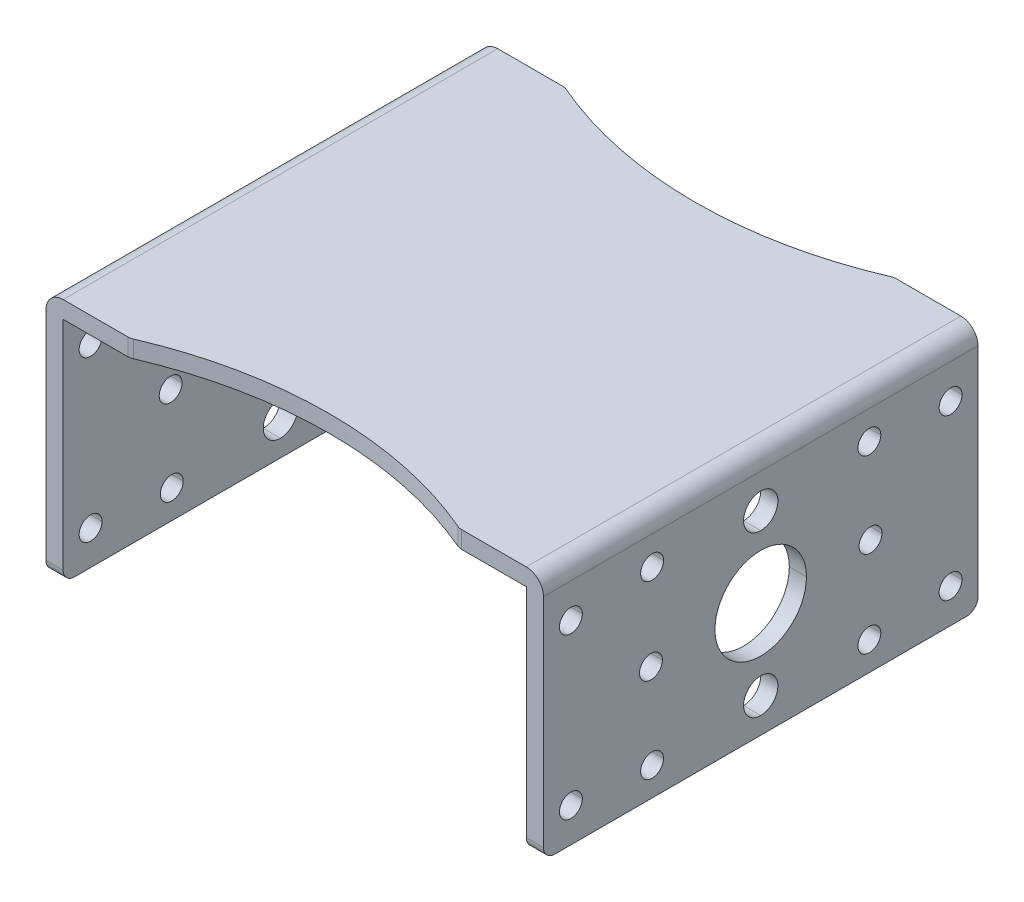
ISO-10303-21;
HEADER;
FILE_DESCRIPTION(('STEP AP214'),'2;1');
FILE_NAME('part.step','',(''),(''),'','','');
FILE_SCHEMA(('AUTOMOTIVE_DESIGN { 1 0 10303 214 1 1 1 1 }'));
ENDSEC;
DATA;
#1=APPLICATION_CONTEXT('core data for automotive mechanical design processes');
#2=APPLICATION_PROTOCOL_DEFINITION('international standard','automotive_design',2000,#1);
#3=PRODUCT_CONTEXT('',#1,'mechanical');
#4=PRODUCT('Part','Part','',(#3));
#5=PRODUCT_RELATED_PRODUCT_CATEGORY('part','',(#4));
#6=PRODUCT_DEFINITION_FORMATION('','',#4);
#7=PRODUCT_DEFINITION_CONTEXT('part definition',#1,'design');
#8=PRODUCT_DEFINITION('design','',#6,#7);
#9=PRODUCT_DEFINITION_SHAPE('','',#8);
#10=(LENGTH_UNIT() NAMED_UNIT(*) SI_UNIT(.MILLI.,.METRE.));
#11=(NAMED_UNIT(*) PLANE_ANGLE_UNIT() SI_UNIT($,.RADIAN.));
#12=(NAMED_UNIT(*) SI_UNIT($,.STERADIAN.) SOLID_ANGLE_UNIT());
#13=UNCERTAINTY_MEASURE_WITH_UNIT(LENGTH_MEASURE(1.E-05),#10,'distance_accuracy_value','');
#14=(GEOMETRIC_REPRESENTATION_CONTEXT(3) GLOBAL_UNCERTAINTY_ASSIGNED_CONTEXT((#13)) GLOBAL_UNIT_ASSIGNED_CONTEXT((#10,
#11,#12)) REPRESENTATION_CONTEXT('',''));
#15=CARTESIAN_POINT('',(0.,0.,0.));
#16=DIRECTION('',(0.,0.,1.));
#17=DIRECTION('',(1.,0.,0.));
#18=AXIS2_PLACEMENT_3D('',#15,#16,#17);
#19=CARTESIAN_POINT('',(21.75,-17.,0.));
#20=DIRECTION('',(1.,0.,0.));
#21=DIRECTION('',(0.,1.,0.));
#22=AXIS2_PLACEMENT_3D('',#19,#20,#21);
#23=CYLINDRICAL_SURFACE('',#22,1.5);
#24=DIRECTION('',(-1.,0.,0.));
#25=VECTOR('',#24,1.);
#26=CARTESIAN_POINT('',(-20.25,-18.5,0.));
#27=LINE('',#26,#25);
#28=CARTESIAN_POINT('',(-20.25,-18.5,0.));
#29=VERTEX_POINT('',#28);
#30=CARTESIAN_POINT('',(-21.75,-18.5,0.));
#31=VERTEX_POINT('',#30);
#32=EDGE_CURVE('E11',#29,#31,#27,.T.);
#33=ORIENTED_EDGE('',*,*,#32,.F.);
#34=CARTESIAN_POINT('',(-20.25,-17.,0.));
#35=DIRECTION('',(1.,0.,0.));
#36=DIRECTION('',(0.,-1.,0.));
#37=AXIS2_PLACEMENT_3D('',#34,#35,#36);
#38=CIRCLE('',#37,1.5);
#39=CARTESIAN_POINT('',(-20.25,-15.5,0.));
#40=VERTEX_POINT('',#39);
#41=EDGE_CURVE('E628',#29,#40,#38,.T.);
#42=ORIENTED_EDGE('',*,*,#41,.T.);
#43=DIRECTION('',(-1.,0.,0.));
#44=VECTOR('',#43,1.);
#45=CARTESIAN_POINT('',(-20.25,-15.5,0.));
#46=LINE('',#45,#44);
#47=CARTESIAN_POINT('',(-21.75,-15.5,0.));
#48=VERTEX_POINT('',#47);
#49=EDGE_CURVE('E28',#40,#48,#46,.T.);
#50=ORIENTED_EDGE('',*,*,#49,.T.);
#51=CARTESIAN_POINT('',(-21.75,-17.,0.));
#52=DIRECTION('',(1.,0.,0.));
#53=DIRECTION('',(0.,-1.,0.));
#54=AXIS2_PLACEMENT_3D('',#51,#52,#53);
#55=CIRCLE('',#54,1.5);
#56=EDGE_CURVE('E408',#31,#48,#55,.T.);
#57=ORIENTED_EDGE('',*,*,#56,.F.);
#58=EDGE_LOOP('',(#33,#42,#50,#57));
#59=FACE_BOUND('',#58,.T.);
#60=ADVANCED_FACE('F17',(#59),#23,.F.);
#61=CARTESIAN_POINT('',(21.75,-17.,0.));
#62=DIRECTION('',(1.,0.,0.));
#63=DIRECTION('',(0.,1.,0.));
#64=AXIS2_PLACEMENT_3D('',#61,#62,#63);
#65=CYLINDRICAL_SURFACE('',#64,1.5);
#66=DIRECTION('',(-1.,0.,0.));
#67=VECTOR('',#66,1.);
#68=CARTESIAN_POINT('',(21.75,-18.5,0.));
#69=LINE('',#68,#67);
#70=CARTESIAN_POINT('',(21.75,-18.5,0.));
#71=VERTEX_POINT('',#70);
#72=CARTESIAN_POINT('',(20.25,-18.5,0.));
#73=VERTEX_POINT('',#72);
#74=EDGE_CURVE('E606',#71,#73,#69,.T.);
#75=ORIENTED_EDGE('',*,*,#74,.F.);
#76=CARTESIAN_POINT('',(21.75,-17.,0.));
#77=DIRECTION('',(1.,0.,0.));
#78=DIRECTION('',(0.,-1.,0.));
#79=AXIS2_PLACEMENT_3D('',#76,#77,#78);
#80=CIRCLE('',#79,1.5);
#81=CARTESIAN_POINT('',(21.75,-15.5,0.));
#82=VERTEX_POINT('',#81);
#83=EDGE_CURVE('E985',#71,#82,#80,.T.);
#84=ORIENTED_EDGE('',*,*,#83,.T.);
#85=DIRECTION('',(-1.,0.,0.));
#86=VECTOR('',#85,1.);
#87=CARTESIAN_POINT('',(21.75,-15.5,0.));
#88=LINE('',#87,#86);
#89=CARTESIAN_POINT('',(20.25,-15.5,0.));
#90=VERTEX_POINT('',#89);
#91=EDGE_CURVE('E560',#82,#90,#88,.T.);
#92=ORIENTED_EDGE('',*,*,#91,.T.);
#93=CARTESIAN_POINT('',(20.25,-17.,0.));
#94=DIRECTION('',(1.,0.,0.));
#95=DIRECTION('',(0.,-1.,0.));
#96=AXIS2_PLACEMENT_3D('',#93,#94,#95);
#97=CIRCLE('',#96,1.5);
#98=EDGE_CURVE('E475',#73,#90,#97,.T.);
#99=ORIENTED_EDGE('',*,*,#98,.F.);
#100=EDGE_LOOP('',(#75,#84,#92,#99));
#101=FACE_BOUND('',#100,.T.);
#102=ADVANCED_FACE('F1172',(#101),#65,.F.);
#103=CARTESIAN_POINT('',(21.75,-17.,0.));
#104=DIRECTION('',(1.,0.,0.));
#105=DIRECTION('',(0.,1.,0.));
#106=AXIS2_PLACEMENT_3D('',#103,#104,#105);
#107=CYLINDRICAL_SURFACE('',#106,1.5);
#108=ORIENTED_EDGE('',*,*,#49,.F.);
#109=CARTESIAN_POINT('',(-20.25,-17.,0.));
#110=DIRECTION('',(1.,0.,0.));
#111=DIRECTION('',(0.,1.,0.));
#112=AXIS2_PLACEMENT_3D('',#109,#110,#111);
#113=CIRCLE('',#112,1.5);
#114=EDGE_CURVE('E747',#40,#29,#113,.T.);
#115=ORIENTED_EDGE('',*,*,#114,.T.);
#116=ORIENTED_EDGE('',*,*,#32,.T.);
#117=CARTESIAN_POINT('',(-21.75,-17.,0.));
#118=DIRECTION('',(1.,0.,0.));
#119=DIRECTION('',(0.,1.,0.));
#120=AXIS2_PLACEMENT_3D('',#117,#118,#119);
#121=CIRCLE('',#120,1.5);
#122=EDGE_CURVE('E411',#48,#31,#121,.T.);
#123=ORIENTED_EDGE('',*,*,#122,.F.);
#124=EDGE_LOOP('',(#108,#115,#116,#123));
#125=FACE_BOUND('',#124,.T.);
#126=ADVANCED_FACE('F1626',(#125),#107,.F.);
#127=CARTESIAN_POINT('',(21.75,-17.,0.));
#128=DIRECTION('',(1.,0.,0.));
#129=DIRECTION('',(0.,1.,0.));
#130=AXIS2_PLACEMENT_3D('',#127,#128,#129);
#131=CYLINDRICAL_SURFACE('',#130,1.5);
#132=ORIENTED_EDGE('',*,*,#91,.F.);
#133=CARTESIAN_POINT('',(21.75,-17.,0.));
#134=DIRECTION('',(1.,0.,0.));
#135=DIRECTION('',(0.,1.,0.));
#136=AXIS2_PLACEMENT_3D('',#133,#134,#135);
#137=CIRCLE('',#136,1.5);
#138=EDGE_CURVE('E961',#82,#71,#137,.T.);
#139=ORIENTED_EDGE('',*,*,#138,.T.);
#140=ORIENTED_EDGE('',*,*,#74,.T.);
#141=CARTESIAN_POINT('',(20.25,-17.,0.));
#142=DIRECTION('',(1.,0.,0.));
#143=DIRECTION('',(0.,1.,0.));
#144=AXIS2_PLACEMENT_3D('',#141,#142,#143);
#145=CIRCLE('',#144,1.5);
#146=EDGE_CURVE('E552',#90,#73,#145,.T.);
#147=ORIENTED_EDGE('',*,*,#146,.F.);
#148=EDGE_LOOP('',(#132,#139,#140,#147));
#149=FACE_BOUND('',#148,.T.);
#150=ADVANCED_FACE('F1159',(#149),#131,.F.);
#151=CARTESIAN_POINT('',(-21.,-17.5,-9.5));
#152=DIRECTION('',(-1.,0.,0.));
#153=DIRECTION('',(0.,0.,1.));
#154=AXIS2_PLACEMENT_3D('',#151,#152,#153);
#155=CYLINDRICAL_SURFACE('',#154,1.);
#156=DIRECTION('',(1.,0.,0.));
#157=VECTOR('',#156,1.);
#158=CARTESIAN_POINT('',(-21.75,-17.5,-10.5));
#159=LINE('',#158,#157);
#160=CARTESIAN_POINT('',(-21.75,-17.5,-10.5));
#161=VERTEX_POINT('',#160);
#162=CARTESIAN_POINT('',(-20.25,-17.5,-10.5));
#163=VERTEX_POINT('',#162);
#164=EDGE_CURVE('E557',#161,#163,#159,.T.);
#165=ORIENTED_EDGE('',*,*,#164,.F.);
#166=CARTESIAN_POINT('',(-21.75,-17.5,-9.5));
#167=DIRECTION('',(1.,0.,0.));
#168=DIRECTION('',(0.,0.,1.));
#169=AXIS2_PLACEMENT_3D('',#166,#167,#168);
#170=CIRCLE('',#169,1.);
#171=CARTESIAN_POINT('',(-21.75,-17.5,-8.5));
#172=VERTEX_POINT('',#171);
#173=EDGE_CURVE('E925',#172,#161,#170,.T.);
#174=ORIENTED_EDGE('',*,*,#173,.F.);
#175=DIRECTION('',(1.,0.,0.));
#176=VECTOR('',#175,1.);
#177=CARTESIAN_POINT('',(-21.75,-17.5,-8.5));
#178=LINE('',#177,#176);
#179=CARTESIAN_POINT('',(-20.25,-17.5,-8.5));
#180=VERTEX_POINT('',#179);
#181=EDGE_CURVE('E561',#172,#180,#178,.T.);
#182=ORIENTED_EDGE('',*,*,#181,.T.);
#183=CARTESIAN_POINT('',(-20.25,-17.5,-9.5));
#184=DIRECTION('',(-1.,0.,0.));
#185=DIRECTION('',(0.,0.,-1.));
#186=AXIS2_PLACEMENT_3D('',#183,#184,#185);
#187=CIRCLE('',#186,1.);
#188=EDGE_CURVE('E629',#163,#180,#187,.T.);
#189=ORIENTED_EDGE('',*,*,#188,.F.);
#190=EDGE_LOOP('',(#165,#174,#182,#189));
#191=FACE_BOUND('',#190,.T.);
#192=ADVANCED_FACE('F1862',(#191),#155,.F.);
#193=CARTESIAN_POINT('',(-21.,-17.5,-9.5));
#194=DIRECTION('',(-1.,0.,0.));
#195=DIRECTION('',(0.,0.,1.));
#196=AXIS2_PLACEMENT_3D('',#193,#194,#195);
#197=CYLINDRICAL_SURFACE('',#196,1.);
#198=CARTESIAN_POINT('',(-20.25,-17.5,-9.5));
#199=DIRECTION('',(-1.,0.,0.));
#200=DIRECTION('',(0.,0.,1.));
#201=AXIS2_PLACEMENT_3D('',#198,#199,#200);
#202=CIRCLE('',#201,1.);
#203=EDGE_CURVE('E625',#180,#163,#202,.T.);
#204=ORIENTED_EDGE('',*,*,#203,.F.);
#205=ORIENTED_EDGE('',*,*,#181,.F.);
#206=CARTESIAN_POINT('',(-21.75,-17.5,-9.5));
#207=DIRECTION('',(1.,0.,0.));
#208=DIRECTION('',(0.,0.,-1.));
#209=AXIS2_PLACEMENT_3D('',#206,#207,#208);
#210=CIRCLE('',#209,1.);
#211=EDGE_CURVE('E458',#161,#172,#210,.T.);
#212=ORIENTED_EDGE('',*,*,#211,.F.);
#213=ORIENTED_EDGE('',*,*,#164,.T.);
#214=EDGE_LOOP('',(#204,#205,#212,#213));
#215=FACE_BOUND('',#214,.T.);
#216=ADVANCED_FACE('F1772',(#215),#197,.F.);
#217=CARTESIAN_POINT('',(-21.,-17.,-16.6));
#218=DIRECTION('',(-1.,0.,0.));
#219=DIRECTION('',(0.,0.,1.));
#220=AXIS2_PLACEMENT_3D('',#217,#218,#219);
#221=CYLINDRICAL_SURFACE('',#220,1.);
#222=DIRECTION('',(1.,0.,0.));
#223=VECTOR('',#222,1.);
#224=CARTESIAN_POINT('',(-21.75,-17.,-17.6));
#225=LINE('',#224,#223);
#226=CARTESIAN_POINT('',(-21.75,-17.,-17.6));
#227=VERTEX_POINT('',#226);
#228=CARTESIAN_POINT('',(-20.25,-17.,-17.6));
#229=VERTEX_POINT('',#228);
#230=EDGE_CURVE('E568',#227,#229,#225,.T.);
#231=ORIENTED_EDGE('',*,*,#230,.F.);
#232=CARTESIAN_POINT('',(-21.75,-17.,-16.6));
#233=DIRECTION('',(1.,0.,0.));
#234=DIRECTION('',(0.,0.,1.));
#235=AXIS2_PLACEMENT_3D('',#232,#233,#234);
#236=CIRCLE('',#235,1.);
#237=CARTESIAN_POINT('',(-21.75,-17.,-15.6));
#238=VERTEX_POINT('',#237);
#239=EDGE_CURVE('E453',#238,#227,#236,.T.);
#240=ORIENTED_EDGE('',*,*,#239,.F.);
#241=DIRECTION('',(1.,0.,0.));
#242=VECTOR('',#241,1.);
#243=CARTESIAN_POINT('',(-21.75,-17.,-15.6));
#244=LINE('',#243,#242);
#245=CARTESIAN_POINT('',(-20.25,-17.,-15.6));
#246=VERTEX_POINT('',#245);
#247=EDGE_CURVE('E572',#238,#246,#244,.T.);
#248=ORIENTED_EDGE('',*,*,#247,.T.);
#249=CARTESIAN_POINT('',(-20.25,-17.,-16.6));
#250=DIRECTION('',(-1.,0.,0.));
#251=DIRECTION('',(0.,0.,-1.));
#252=AXIS2_PLACEMENT_3D('',#249,#250,#251);
#253=CIRCLE('',#252,1.);
#254=EDGE_CURVE('E740',#229,#246,#253,.T.);
#255=ORIENTED_EDGE('',*,*,#254,.F.);
#256=EDGE_LOOP('',(#231,#240,#248,#255));
#257=FACE_BOUND('',#256,.T.);
#258=ADVANCED_FACE('F1909',(#257),#221,.F.);
#259=CARTESIAN_POINT('',(-21.,-17.,-16.6));
#260=DIRECTION('',(-1.,0.,0.));
#261=DIRECTION('',(0.,0.,1.));
#262=AXIS2_PLACEMENT_3D('',#259,#260,#261);
#263=CYLINDRICAL_SURFACE('',#262,1.);
#264=CARTESIAN_POINT('',(-20.25,-17.,-16.6));
#265=DIRECTION('',(-1.,0.,0.));
#266=DIRECTION('',(0.,0.,1.));
#267=AXIS2_PLACEMENT_3D('',#264,#265,#266);
#268=CIRCLE('',#267,1.);
#269=EDGE_CURVE('E744',#246,#229,#268,.T.);
#270=ORIENTED_EDGE('',*,*,#269,.F.);
#271=ORIENTED_EDGE('',*,*,#247,.F.);
#272=CARTESIAN_POINT('',(-21.75,-17.,-16.6));
#273=DIRECTION('',(1.,0.,0.));
#274=DIRECTION('',(0.,0.,-1.));
#275=AXIS2_PLACEMENT_3D('',#272,#273,#274);
#276=CIRCLE('',#275,1.);
#277=EDGE_CURVE('E457',#227,#238,#276,.T.);
#278=ORIENTED_EDGE('',*,*,#277,.F.);
#279=ORIENTED_EDGE('',*,*,#230,.T.);
#280=EDGE_LOOP('',(#270,#271,#278,#279));
#281=FACE_BOUND('',#280,.T.);
#282=ADVANCED_FACE('F1917',(#281),#263,.F.);
#283=CARTESIAN_POINT('',(-21.,-3.,-16.6));
#284=DIRECTION('',(-1.,0.,0.));
#285=DIRECTION('',(0.,0.,1.));
#286=AXIS2_PLACEMENT_3D('',#283,#284,#285);
#287=CYLINDRICAL_SURFACE('',#286,1.);
#288=DIRECTION('',(1.,0.,0.));
#289=VECTOR('',#288,1.);
#290=CARTESIAN_POINT('',(-21.75,-3.,-17.6));
#291=LINE('',#290,#289);
#292=CARTESIAN_POINT('',(-21.75,-3.,-17.6));
#293=VERTEX_POINT('',#292);
#294=CARTESIAN_POINT('',(-20.25,-3.,-17.6));
#295=VERTEX_POINT('',#294);
#296=EDGE_CURVE('E21',#293,#295,#291,.T.);
#297=ORIENTED_EDGE('',*,*,#296,.F.);
#298=CARTESIAN_POINT('',(-21.75,-3.,-16.6));
#299=DIRECTION('',(1.,0.,0.));
#300=DIRECTION('',(0.,0.,1.));
#301=AXIS2_PLACEMENT_3D('',#298,#299,#300);
#302=CIRCLE('',#301,1.);
#303=CARTESIAN_POINT('',(-21.75,-3.,-15.6));
#304=VERTEX_POINT('',#303);
#305=EDGE_CURVE('E1079',#304,#293,#302,.T.);
#306=ORIENTED_EDGE('',*,*,#305,.F.);
#307=DIRECTION('',(1.,0.,0.));
#308=VECTOR('',#307,1.);
#309=CARTESIAN_POINT('',(-21.75,-3.,-15.6));
#310=LINE('',#309,#308);
#311=CARTESIAN_POINT('',(-20.25,-3.,-15.6));
#312=VERTEX_POINT('',#311);
#313=EDGE_CURVE('E888',#304,#312,#310,.T.);
#314=ORIENTED_EDGE('',*,*,#313,.T.);
#315=CARTESIAN_POINT('',(-20.25,-3.,-16.6));
#316=DIRECTION('',(-1.,0.,0.));
#317=DIRECTION('',(0.,0.,-1.));
#318=AXIS2_PLACEMENT_3D('',#315,#316,#317);
#319=CIRCLE('',#318,1.);
#320=EDGE_CURVE('E523',#295,#312,#319,.T.);
#321=ORIENTED_EDGE('',*,*,#320,.F.);
#322=EDGE_LOOP('',(#297,#306,#314,#321));
#323=FACE_BOUND('',#322,.T.);
#324=ADVANCED_FACE('F1832',(#323),#287,.F.);
#325=CARTESIAN_POINT('',(-21.,-3.,-16.6));
#326=DIRECTION('',(-1.,0.,0.));
#327=DIRECTION('',(0.,0.,1.));
#328=AXIS2_PLACEMENT_3D('',#325,#326,#327);
#329=CYLINDRICAL_SURFACE('',#328,1.);
#330=CARTESIAN_POINT('',(-20.25,-3.,-16.6));
#331=DIRECTION('',(-1.,0.,0.));
#332=DIRECTION('',(0.,0.,1.));
#333=AXIS2_PLACEMENT_3D('',#330,#331,#332);
#334=CIRCLE('',#333,1.);
#335=EDGE_CURVE('E527',#312,#295,#334,.T.);
#336=ORIENTED_EDGE('',*,*,#335,.F.);
#337=ORIENTED_EDGE('',*,*,#313,.F.);
#338=CARTESIAN_POINT('',(-21.75,-3.,-16.6));
#339=DIRECTION('',(1.,0.,0.));
#340=DIRECTION('',(0.,0.,-1.));
#341=AXIS2_PLACEMENT_3D('',#338,#339,#340);
#342=CIRCLE('',#341,1.);
#343=EDGE_CURVE('E643',#293,#304,#342,.T.);
#344=ORIENTED_EDGE('',*,*,#343,.F.);
#345=ORIENTED_EDGE('',*,*,#296,.T.);
#346=EDGE_LOOP('',(#336,#337,#344,#345));
#347=FACE_BOUND('',#346,.T.);
#348=ADVANCED_FACE('F1830',(#347),#329,.F.);
#349=CARTESIAN_POINT('',(-21.,-2.5,-9.5));
#350=DIRECTION('',(-1.,0.,0.));
#351=DIRECTION('',(0.,0.,1.));
#352=AXIS2_PLACEMENT_3D('',#349,#350,#351);
#353=CYLINDRICAL_SURFACE('',#352,1.);
#354=DIRECTION('',(1.,0.,0.));
#355=VECTOR('',#354,1.);
#356=CARTESIAN_POINT('',(-21.75,-2.5,-10.5));
#357=LINE('',#356,#355);
#358=CARTESIAN_POINT('',(-21.75,-2.5,-10.5));
#359=VERTEX_POINT('',#358);
#360=CARTESIAN_POINT('',(-20.25,-2.5,-10.5));
#361=VERTEX_POINT('',#360);
#362=EDGE_CURVE('E884',#359,#361,#357,.T.);
#363=ORIENTED_EDGE('',*,*,#362,.F.);
#364=CARTESIAN_POINT('',(-21.75,-2.5,-9.5));
#365=DIRECTION('',(1.,0.,0.));
#366=DIRECTION('',(0.,0.,1.));
#367=AXIS2_PLACEMENT_3D('',#364,#365,#366);
#368=CIRCLE('',#367,1.);
#369=CARTESIAN_POINT('',(-21.75,-2.5,-8.5));
#370=VERTEX_POINT('',#369);
#371=EDGE_CURVE('E516',#370,#359,#368,.T.);
#372=ORIENTED_EDGE('',*,*,#371,.F.);
#373=DIRECTION('',(1.,0.,0.));
#374=VECTOR('',#373,1.);
#375=CARTESIAN_POINT('',(-21.75,-2.5,-8.5));
#376=LINE('',#375,#374);
#377=CARTESIAN_POINT('',(-20.25,-2.5,-8.5));
#378=VERTEX_POINT('',#377);
#379=EDGE_CURVE('E679',#370,#378,#376,.T.);
#380=ORIENTED_EDGE('',*,*,#379,.T.);
#381=CARTESIAN_POINT('',(-20.25,-2.5,-9.5));
#382=DIRECTION('',(-1.,0.,0.));
#383=DIRECTION('',(0.,0.,-1.));
#384=AXIS2_PLACEMENT_3D('',#381,#382,#383);
#385=CIRCLE('',#384,1.);
#386=EDGE_CURVE('E602',#361,#378,#385,.T.);
#387=ORIENTED_EDGE('',*,*,#386,.F.);
#388=EDGE_LOOP('',(#363,#372,#380,#387));
#389=FACE_BOUND('',#388,.T.);
#390=ADVANCED_FACE('F1821',(#389),#353,.F.);
#391=CARTESIAN_POINT('',(-21.,-2.5,-9.5));
#392=DIRECTION('',(-1.,0.,0.));
#393=DIRECTION('',(0.,0.,1.));
#394=AXIS2_PLACEMENT_3D('',#391,#392,#393);
#395=CYLINDRICAL_SURFACE('',#394,1.);
#396=CARTESIAN_POINT('',(-20.25,-2.5,-9.5));
#397=DIRECTION('',(-1.,0.,0.));
#398=DIRECTION('',(0.,0.,1.));
#399=AXIS2_PLACEMENT_3D('',#396,#397,#398);
#400=CIRCLE('',#399,1.);
#401=EDGE_CURVE('E528',#378,#361,#400,.T.);
#402=ORIENTED_EDGE('',*,*,#401,.F.);
#403=ORIENTED_EDGE('',*,*,#379,.F.);
#404=CARTESIAN_POINT('',(-21.75,-2.5,-9.5));
#405=DIRECTION('',(1.,0.,0.));
#406=DIRECTION('',(0.,0.,-1.));
#407=AXIS2_PLACEMENT_3D('',#404,#405,#406);
#408=CIRCLE('',#407,1.);
#409=EDGE_CURVE('E511',#359,#370,#408,.T.);
#410=ORIENTED_EDGE('',*,*,#409,.F.);
#411=ORIENTED_EDGE('',*,*,#362,.T.);
#412=EDGE_LOOP('',(#402,#403,#410,#411));
#413=FACE_BOUND('',#412,.T.);
#414=ADVANCED_FACE('F1795',(#413),#395,.F.);
#415=CARTESIAN_POINT('',(-21.,-2.5,9.5));
#416=DIRECTION('',(-1.,0.,0.));
#417=DIRECTION('',(0.,0.,1.));
#418=AXIS2_PLACEMENT_3D('',#415,#416,#417);
#419=CYLINDRICAL_SURFACE('',#418,1.);
#420=DIRECTION('',(1.,0.,0.));
#421=VECTOR('',#420,1.);
#422=CARTESIAN_POINT('',(-21.75,-2.5,8.5));
#423=LINE('',#422,#421);
#424=CARTESIAN_POINT('',(-21.75,-2.5,8.5));
#425=VERTEX_POINT('',#424);
#426=CARTESIAN_POINT('',(-20.25,-2.5,8.5));
#427=VERTEX_POINT('',#426);
#428=EDGE_CURVE('E676',#425,#427,#423,.T.);
#429=ORIENTED_EDGE('',*,*,#428,.F.);
#430=CARTESIAN_POINT('',(-21.75,-2.5,9.5));
#431=DIRECTION('',(1.,0.,0.));
#432=DIRECTION('',(0.,0.,1.));
#433=AXIS2_PLACEMENT_3D('',#430,#431,#432);
#434=CIRCLE('',#433,1.);
#435=CARTESIAN_POINT('',(-21.75,-2.5,10.5));
#436=VERTEX_POINT('',#435);
#437=EDGE_CURVE('E515',#436,#425,#434,.T.);
#438=ORIENTED_EDGE('',*,*,#437,.F.);
#439=DIRECTION('',(1.,0.,0.));
#440=VECTOR('',#439,1.);
#441=CARTESIAN_POINT('',(-21.75,-2.5,10.5));
#442=LINE('',#441,#440);
#443=CARTESIAN_POINT('',(-20.25,-2.5,10.5));
#444=VERTEX_POINT('',#443);
#445=EDGE_CURVE('E680',#436,#444,#442,.T.);
#446=ORIENTED_EDGE('',*,*,#445,.T.);
#447=CARTESIAN_POINT('',(-20.25,-2.5,9.5));
#448=DIRECTION('',(-1.,0.,0.));
#449=DIRECTION('',(0.,0.,-1.));
#450=AXIS2_PLACEMENT_3D('',#447,#448,#449);
#451=CIRCLE('',#450,1.);
#452=EDGE_CURVE('E603',#427,#444,#451,.T.);
#453=ORIENTED_EDGE('',*,*,#452,.F.);
#454=EDGE_LOOP('',(#429,#438,#446,#453));
#455=FACE_BOUND('',#454,.T.);
#456=ADVANCED_FACE('F1792',(#455),#419,.F.);
#457=CARTESIAN_POINT('',(-21.,-2.5,9.5));
#458=DIRECTION('',(-1.,0.,0.));
#459=DIRECTION('',(0.,0.,1.));
#460=AXIS2_PLACEMENT_3D('',#457,#458,#459);
#461=CYLINDRICAL_SURFACE('',#460,1.);
#462=CARTESIAN_POINT('',(-20.25,-2.5,9.5));
#463=DIRECTION('',(-1.,0.,0.));
#464=DIRECTION('',(0.,0.,1.));
#465=AXIS2_PLACEMENT_3D('',#462,#463,#464);
#466=CIRCLE('',#465,1.);
#467=EDGE_CURVE('E598',#444,#427,#466,.T.);
#468=ORIENTED_EDGE('',*,*,#467,.F.);
#469=ORIENTED_EDGE('',*,*,#445,.F.);
#470=CARTESIAN_POINT('',(-21.75,-2.5,9.5));
#471=DIRECTION('',(1.,0.,0.));
#472=DIRECTION('',(0.,0.,-1.));
#473=AXIS2_PLACEMENT_3D('',#470,#471,#472);
#474=CIRCLE('',#473,1.);
#475=EDGE_CURVE('E674',#425,#436,#474,.T.);
#476=ORIENTED_EDGE('',*,*,#475,.F.);
#477=ORIENTED_EDGE('',*,*,#428,.T.);
#478=EDGE_LOOP('',(#468,#469,#476,#477));
#479=FACE_BOUND('',#478,.T.);
#480=ADVANCED_FACE('F1794',(#479),#461,.F.);
#481=CARTESIAN_POINT('',(-21.,-10.,9.6));
#482=DIRECTION('',(-1.,0.,0.));
#483=DIRECTION('',(0.,0.,1.));
#484=AXIS2_PLACEMENT_3D('',#481,#482,#483);
#485=CYLINDRICAL_SURFACE('',#484,1.);
#486=DIRECTION('',(1.,0.,0.));
#487=VECTOR('',#486,1.);
#488=CARTESIAN_POINT('',(-21.75,-10.,8.6));
#489=LINE('',#488,#487);
#490=CARTESIAN_POINT('',(-21.75,-10.,8.6));
#491=VERTEX_POINT('',#490);
#492=CARTESIAN_POINT('',(-20.25,-10.,8.6));
#493=VERTEX_POINT('',#492);
#494=EDGE_CURVE('E597',#491,#493,#489,.T.);
#495=ORIENTED_EDGE('',*,*,#494,.F.);
#496=CARTESIAN_POINT('',(-21.75,-10.,9.6));
#497=DIRECTION('',(1.,0.,0.));
#498=DIRECTION('',(0.,0.,1.));
#499=AXIS2_PLACEMENT_3D('',#496,#497,#498);
#500=CIRCLE('',#499,1.);
#501=CARTESIAN_POINT('',(-21.75,-10.,10.6));
#502=VERTEX_POINT('',#501);
#503=EDGE_CURVE('E670',#502,#491,#500,.T.);
#504=ORIENTED_EDGE('',*,*,#503,.F.);
#505=DIRECTION('',(1.,0.,0.));
#506=VECTOR('',#505,1.);
#507=CARTESIAN_POINT('',(-21.75,-10.,10.6));
#508=LINE('',#507,#506);
#509=CARTESIAN_POINT('',(-20.25,-10.,10.6));
#510=VERTEX_POINT('',#509);
#511=EDGE_CURVE('E383',#502,#510,#508,.T.);
#512=ORIENTED_EDGE('',*,*,#511,.T.);
#513=CARTESIAN_POINT('',(-20.25,-10.,9.6));
#514=DIRECTION('',(-1.,0.,0.));
#515=DIRECTION('',(0.,0.,-1.));
#516=AXIS2_PLACEMENT_3D('',#513,#514,#515);
#517=CIRCLE('',#516,1.);
#518=EDGE_CURVE('E391',#493,#510,#517,.T.);
#519=ORIENTED_EDGE('',*,*,#518,.F.);
#520=EDGE_LOOP('',(#495,#504,#512,#519));
#521=FACE_BOUND('',#520,.T.);
#522=ADVANCED_FACE('F1965',(#521),#485,.F.);
#523=CARTESIAN_POINT('',(-21.,-10.,9.6));
#524=DIRECTION('',(-1.,0.,0.));
#525=DIRECTION('',(0.,0.,1.));
#526=AXIS2_PLACEMENT_3D('',#523,#524,#525);
#527=CYLINDRICAL_SURFACE('',#526,1.);
#528=CARTESIAN_POINT('',(-20.25,-10.,9.6));
#529=DIRECTION('',(-1.,0.,0.));
#530=DIRECTION('',(0.,0.,1.));
#531=AXIS2_PLACEMENT_3D('',#528,#529,#530);
#532=CIRCLE('',#531,1.);
#533=EDGE_CURVE('E1044',#510,#493,#532,.T.);
#534=ORIENTED_EDGE('',*,*,#533,.F.);
#535=ORIENTED_EDGE('',*,*,#511,.F.);
#536=CARTESIAN_POINT('',(-21.75,-10.,9.6));
#537=DIRECTION('',(1.,0.,0.));
#538=DIRECTION('',(0.,0.,-1.));
#539=AXIS2_PLACEMENT_3D('',#536,#537,#538);
#540=CIRCLE('',#539,1.);
#541=EDGE_CURVE('E673',#491,#502,#540,.T.);
#542=ORIENTED_EDGE('',*,*,#541,.F.);
#543=ORIENTED_EDGE('',*,*,#494,.T.);
#544=EDGE_LOOP('',(#534,#535,#542,#543));
#545=FACE_BOUND('',#544,.T.);
#546=ADVANCED_FACE('F1812',(#545),#527,.F.);
#547=CARTESIAN_POINT('',(-21.,-17.5,9.5));
#548=DIRECTION('',(-1.,0.,0.));
#549=DIRECTION('',(0.,0.,1.));
#550=AXIS2_PLACEMENT_3D('',#547,#548,#549);
#551=CYLINDRICAL_SURFACE('',#550,1.);
#552=DIRECTION('',(1.,0.,0.));
#553=VECTOR('',#552,1.);
#554=CARTESIAN_POINT('',(-21.75,-17.5,8.5));
#555=LINE('',#554,#553);
#556=CARTESIAN_POINT('',(-21.75,-17.5,8.5));
#557=VERTEX_POINT('',#556);
#558=CARTESIAN_POINT('',(-20.25,-17.5,8.5));
#559=VERTEX_POINT('',#558);
#560=EDGE_CURVE('E369',#557,#559,#555,.T.);
#561=ORIENTED_EDGE('',*,*,#560,.F.);
#562=CARTESIAN_POINT('',(-21.75,-17.5,9.5));
#563=DIRECTION('',(1.,0.,0.));
#564=DIRECTION('',(0.,0.,1.));
#565=AXIS2_PLACEMENT_3D('',#562,#563,#564);
#566=CIRCLE('',#565,1.);
#567=CARTESIAN_POINT('',(-21.75,-17.5,10.5));
#568=VERTEX_POINT('',#567);
#569=EDGE_CURVE('E787',#568,#557,#566,.T.);
#570=ORIENTED_EDGE('',*,*,#569,.F.);
#571=DIRECTION('',(1.,0.,0.));
#572=VECTOR('',#571,1.);
#573=CARTESIAN_POINT('',(-21.75,-17.5,10.5));
#574=LINE('',#573,#572);
#575=CARTESIAN_POINT('',(-20.25,-17.5,10.5));
#576=VERTEX_POINT('',#575);
#577=EDGE_CURVE('E384',#568,#576,#574,.T.);
#578=ORIENTED_EDGE('',*,*,#577,.T.);
#579=CARTESIAN_POINT('',(-20.25,-17.5,9.5));
#580=DIRECTION('',(-1.,0.,0.));
#581=DIRECTION('',(0.,0.,-1.));
#582=AXIS2_PLACEMENT_3D('',#579,#580,#581);
#583=CIRCLE('',#582,1.);
#584=EDGE_CURVE('E389',#559,#576,#583,.T.);
#585=ORIENTED_EDGE('',*,*,#584,.F.);
#586=EDGE_LOOP('',(#561,#570,#578,#585));
#587=FACE_BOUND('',#586,.T.);
#588=ADVANCED_FACE('F393',(#587),#551,.F.);
#589=CARTESIAN_POINT('',(-21.,-17.5,9.5));
#590=DIRECTION('',(-1.,0.,0.));
#591=DIRECTION('',(0.,0.,1.));
#592=AXIS2_PLACEMENT_3D('',#589,#590,#591);
#593=CYLINDRICAL_SURFACE('',#592,1.);
#594=CARTESIAN_POINT('',(-20.25,-17.5,9.5));
#595=DIRECTION('',(-1.,0.,0.));
#596=DIRECTION('',(0.,0.,1.));
#597=AXIS2_PLACEMENT_3D('',#594,#595,#596);
#598=CIRCLE('',#597,1.);
#599=EDGE_CURVE('E373',#576,#559,#598,.T.);
#600=ORIENTED_EDGE('',*,*,#599,.F.);
#601=ORIENTED_EDGE('',*,*,#577,.F.);
#602=CARTESIAN_POINT('',(-21.75,-17.5,9.5));
#603=DIRECTION('',(1.,0.,0.));
#604=DIRECTION('',(0.,0.,-1.));
#605=AXIS2_PLACEMENT_3D('',#602,#603,#604);
#606=CIRCLE('',#605,1.);
#607=EDGE_CURVE('E377',#557,#568,#606,.T.);
#608=ORIENTED_EDGE('',*,*,#607,.F.);
#609=ORIENTED_EDGE('',*,*,#560,.T.);
#610=EDGE_LOOP('',(#600,#601,#608,#609));
#611=FACE_BOUND('',#610,.T.);
#612=ADVANCED_FACE('F371',(#611),#593,.F.);
#613=CARTESIAN_POINT('',(-21.,-17.,16.6));
#614=DIRECTION('',(-1.,0.,0.));
#615=DIRECTION('',(0.,0.,1.));
#616=AXIS2_PLACEMENT_3D('',#613,#614,#615);
#617=CYLINDRICAL_SURFACE('',#616,1.);
#618=DIRECTION('',(1.,0.,0.));
#619=VECTOR('',#618,1.);
#620=CARTESIAN_POINT('',(-21.75,-17.,15.6));
#621=LINE('',#620,#619);
#622=CARTESIAN_POINT('',(-21.75,-17.,15.6));
#623=VERTEX_POINT('',#622);
#624=CARTESIAN_POINT('',(-20.25,-17.,15.6));
#625=VERTEX_POINT('',#624);
#626=EDGE_CURVE('E422',#623,#625,#621,.T.);
#627=ORIENTED_EDGE('',*,*,#626,.F.);
#628=CARTESIAN_POINT('',(-21.75,-17.,16.6));
#629=DIRECTION('',(1.,0.,0.));
#630=DIRECTION('',(0.,0.,1.));
#631=AXIS2_PLACEMENT_3D('',#628,#629,#630);
#632=CIRCLE('',#631,1.);
#633=CARTESIAN_POINT('',(-21.75,-17.,17.6));
#634=VERTEX_POINT('',#633);
#635=EDGE_CURVE('E730',#634,#623,#632,.T.);
#636=ORIENTED_EDGE('',*,*,#635,.F.);
#637=DIRECTION('',(1.,0.,0.));
#638=VECTOR('',#637,1.);
#639=CARTESIAN_POINT('',(-21.75,-17.,17.6));
#640=LINE('',#639,#638);
#641=CARTESIAN_POINT('',(-20.25,-17.,17.6));
#642=VERTEX_POINT('',#641);
#643=EDGE_CURVE('E419',#634,#642,#640,.T.);
#644=ORIENTED_EDGE('',*,*,#643,.T.);
#645=CARTESIAN_POINT('',(-20.25,-17.,16.6));
#646=DIRECTION('',(-1.,0.,0.));
#647=DIRECTION('',(0.,0.,-1.));
#648=AXIS2_PLACEMENT_3D('',#645,#646,#647);
#649=CIRCLE('',#648,1.);
#650=EDGE_CURVE('E402',#625,#642,#649,.T.);
#651=ORIENTED_EDGE('',*,*,#650,.F.);
#652=EDGE_LOOP('',(#627,#636,#644,#651));
#653=FACE_BOUND('',#652,.T.);
#654=ADVANCED_FACE('F1825',(#653),#617,.F.);
#655=CARTESIAN_POINT('',(-21.,-17.,16.6));
#656=DIRECTION('',(-1.,0.,0.));
#657=DIRECTION('',(0.,0.,1.));
#658=AXIS2_PLACEMENT_3D('',#655,#656,#657);
#659=CYLINDRICAL_SURFACE('',#658,1.);
#660=CARTESIAN_POINT('',(-20.25,-17.,16.6));
#661=DIRECTION('',(-1.,0.,0.));
#662=DIRECTION('',(0.,0.,1.));
#663=AXIS2_PLACEMENT_3D('',#660,#661,#662);
#664=CIRCLE('',#663,1.);
#665=EDGE_CURVE('E395',#642,#625,#664,.T.);
#666=ORIENTED_EDGE('',*,*,#665,.F.);
#667=ORIENTED_EDGE('',*,*,#643,.F.);
#668=CARTESIAN_POINT('',(-21.75,-17.,16.6));
#669=DIRECTION('',(1.,0.,0.));
#670=DIRECTION('',(0.,0.,-1.));
#671=AXIS2_PLACEMENT_3D('',#668,#669,#670);
#672=CIRCLE('',#671,1.);
#673=EDGE_CURVE('E734',#623,#634,#672,.T.);
#674=ORIENTED_EDGE('',*,*,#673,.F.);
#675=ORIENTED_EDGE('',*,*,#626,.T.);
#676=EDGE_LOOP('',(#666,#667,#674,#675));
#677=FACE_BOUND('',#676,.T.);
#678=ADVANCED_FACE('F1828',(#677),#659,.F.);
#679=CARTESIAN_POINT('',(-21.,-3.,16.6));
#680=DIRECTION('',(-1.,0.,0.));
#681=DIRECTION('',(0.,0.,1.));
#682=AXIS2_PLACEMENT_3D('',#679,#680,#681);
#683=CYLINDRICAL_SURFACE('',#682,1.);
#684=DIRECTION('',(1.,0.,0.));
#685=VECTOR('',#684,1.);
#686=CARTESIAN_POINT('',(-21.75,-3.,15.6));
#687=LINE('',#686,#685);
#688=CARTESIAN_POINT('',(-21.75,-3.,15.6));
#689=VERTEX_POINT('',#688);
#690=CARTESIAN_POINT('',(-20.25,-3.,15.6));
#691=VERTEX_POINT('',#690);
#692=EDGE_CURVE('E423',#689,#691,#687,.T.);
#693=ORIENTED_EDGE('',*,*,#692,.F.);
#694=CARTESIAN_POINT('',(-21.75,-3.,16.6));
#695=DIRECTION('',(1.,0.,0.));
#696=DIRECTION('',(0.,0.,1.));
#697=AXIS2_PLACEMENT_3D('',#694,#695,#696);
#698=CIRCLE('',#697,1.);
#699=CARTESIAN_POINT('',(-21.75,-3.,17.6));
#700=VERTEX_POINT('',#699);
#701=EDGE_CURVE('E811',#700,#689,#698,.T.);
#702=ORIENTED_EDGE('',*,*,#701,.F.);
#703=DIRECTION('',(1.,0.,0.));
#704=VECTOR('',#703,1.);
#705=CARTESIAN_POINT('',(-21.75,-3.,17.6));
#706=LINE('',#705,#704);
#707=CARTESIAN_POINT('',(-20.25,-3.,17.6));
#708=VERTEX_POINT('',#707);
#709=EDGE_CURVE('E541',#700,#708,#706,.T.);
#710=ORIENTED_EDGE('',*,*,#709,.T.);
#711=CARTESIAN_POINT('',(-20.25,-3.,16.6));
#712=DIRECTION('',(-1.,0.,0.));
#713=DIRECTION('',(0.,0.,-1.));
#714=AXIS2_PLACEMENT_3D('',#711,#712,#713);
#715=CIRCLE('',#714,1.);
#716=EDGE_CURVE('E619',#691,#708,#715,.T.);
#717=ORIENTED_EDGE('',*,*,#716,.F.);
#718=EDGE_LOOP('',(#693,#702,#710,#717));
#719=FACE_BOUND('',#718,.T.);
#720=ADVANCED_FACE('F2005',(#719),#683,.F.);
#721=CARTESIAN_POINT('',(-21.,-3.,16.6));
#722=DIRECTION('',(-1.,0.,0.));
#723=DIRECTION('',(0.,0.,1.));
#724=AXIS2_PLACEMENT_3D('',#721,#722,#723);
#725=CYLINDRICAL_SURFACE('',#724,1.);
#726=CARTESIAN_POINT('',(-20.25,-3.,16.6));
#727=DIRECTION('',(-1.,0.,0.));
#728=DIRECTION('',(0.,0.,1.));
#729=AXIS2_PLACEMENT_3D('',#726,#727,#728);
#730=CIRCLE('',#729,1.);
#731=EDGE_CURVE('E623',#708,#691,#730,.T.);
#732=ORIENTED_EDGE('',*,*,#731,.F.);
#733=ORIENTED_EDGE('',*,*,#709,.F.);
#734=CARTESIAN_POINT('',(-21.75,-3.,16.6));
#735=DIRECTION('',(1.,0.,0.));
#736=DIRECTION('',(0.,0.,-1.));
#737=AXIS2_PLACEMENT_3D('',#734,#735,#736);
#738=CIRCLE('',#737,1.);
#739=EDGE_CURVE('E428',#689,#700,#738,.T.);
#740=ORIENTED_EDGE('',*,*,#739,.F.);
#741=ORIENTED_EDGE('',*,*,#692,.T.);
#742=EDGE_LOOP('',(#732,#733,#740,#741));
#743=FACE_BOUND('',#742,.T.);
#744=ADVANCED_FACE('F1768',(#743),#725,.F.);
#745=CARTESIAN_POINT('',(-21.,-10.,0.));
#746=DIRECTION('',(-1.,0.,0.));
#747=DIRECTION('',(0.,0.,1.));
#748=AXIS2_PLACEMENT_3D('',#745,#746,#747);
#749=CYLINDRICAL_SURFACE('',#748,4.);
#750=DIRECTION('',(1.,0.,0.));
#751=VECTOR('',#750,1.);
#752=CARTESIAN_POINT('',(-21.75,-10.,-4.));
#753=LINE('',#752,#751);
#754=CARTESIAN_POINT('',(-21.75,-10.,-4.));
#755=VERTEX_POINT('',#754);
#756=CARTESIAN_POINT('',(-20.25,-10.,-4.));
#757=VERTEX_POINT('',#756);
#758=EDGE_CURVE('E545',#755,#757,#753,.T.);
#759=ORIENTED_EDGE('',*,*,#758,.F.);
#760=CARTESIAN_POINT('',(-21.75,-10.,0.));
#761=DIRECTION('',(1.,0.,0.));
#762=DIRECTION('',(0.,0.,1.));
#763=AXIS2_PLACEMENT_3D('',#760,#761,#762);
#764=CIRCLE('',#763,4.);
#765=CARTESIAN_POINT('',(-21.75,-10.,4.));
#766=VERTEX_POINT('',#765);
#767=EDGE_CURVE('E704',#766,#755,#764,.T.);
#768=ORIENTED_EDGE('',*,*,#767,.F.);
#769=DIRECTION('',(1.,0.,0.));
#770=VECTOR('',#769,1.);
#771=CARTESIAN_POINT('',(-21.75,-10.,4.));
#772=LINE('',#771,#770);
#773=CARTESIAN_POINT('',(-20.25,-10.,4.));
#774=VERTEX_POINT('',#773);
#775=EDGE_CURVE('E773',#766,#774,#772,.T.);
#776=ORIENTED_EDGE('',*,*,#775,.T.);
#777=CARTESIAN_POINT('',(-20.25,-10.,0.));
#778=DIRECTION('',(-1.,0.,0.));
#779=DIRECTION('',(0.,0.,-1.));
#780=AXIS2_PLACEMENT_3D('',#777,#778,#779);
#781=CIRCLE('',#780,4.);
#782=EDGE_CURVE('E834',#757,#774,#781,.T.);
#783=ORIENTED_EDGE('',*,*,#782,.F.);
#784=EDGE_LOOP('',(#759,#768,#776,#783));
#785=FACE_BOUND('',#784,.T.);
#786=ADVANCED_FACE('F1757',(#785),#749,.F.);
#787=CARTESIAN_POINT('',(-21.,-10.,0.));
#788=DIRECTION('',(-1.,0.,0.));
#789=DIRECTION('',(0.,0.,1.));
#790=AXIS2_PLACEMENT_3D('',#787,#788,#789);
#791=CYLINDRICAL_SURFACE('',#790,4.);
#792=CARTESIAN_POINT('',(-20.25,-10.,0.));
#793=DIRECTION('',(-1.,0.,0.));
#794=DIRECTION('',(0.,0.,1.));
#795=AXIS2_PLACEMENT_3D('',#792,#793,#794);
#796=CIRCLE('',#795,4.);
#797=EDGE_CURVE('E624',#774,#757,#796,.T.);
#798=ORIENTED_EDGE('',*,*,#797,.F.);
#799=ORIENTED_EDGE('',*,*,#775,.F.);
#800=CARTESIAN_POINT('',(-21.75,-10.,0.));
#801=DIRECTION('',(1.,0.,0.));
#802=DIRECTION('',(0.,0.,-1.));
#803=AXIS2_PLACEMENT_3D('',#800,#801,#802);
#804=CIRCLE('',#803,4.);
#805=EDGE_CURVE('E636',#755,#766,#804,.T.);
#806=ORIENTED_EDGE('',*,*,#805,.F.);
#807=ORIENTED_EDGE('',*,*,#758,.T.);
#808=EDGE_LOOP('',(#798,#799,#806,#807));
#809=FACE_BOUND('',#808,.T.);
#810=ADVANCED_FACE('F1759',(#809),#791,.F.);
#811=CARTESIAN_POINT('',(-21.,-10.,-9.6));
#812=DIRECTION('',(-1.,0.,0.));
#813=DIRECTION('',(0.,0.,1.));
#814=AXIS2_PLACEMENT_3D('',#811,#812,#813);
#815=CYLINDRICAL_SURFACE('',#814,1.);
#816=DIRECTION('',(1.,0.,0.));
#817=VECTOR('',#816,1.);
#818=CARTESIAN_POINT('',(-21.75,-10.,-10.6));
#819=LINE('',#818,#817);
#820=CARTESIAN_POINT('',(-21.75,-10.,-10.6));
#821=VERTEX_POINT('',#820);
#822=CARTESIAN_POINT('',(-20.25,-10.,-10.6));
#823=VERTEX_POINT('',#822);
#824=EDGE_CURVE('E771',#821,#823,#819,.T.);
#825=ORIENTED_EDGE('',*,*,#824,.F.);
#826=CARTESIAN_POINT('',(-21.75,-10.,-9.6));
#827=DIRECTION('',(1.,0.,0.));
#828=DIRECTION('',(0.,0.,1.));
#829=AXIS2_PLACEMENT_3D('',#826,#827,#828);
#830=CIRCLE('',#829,1.);
#831=CARTESIAN_POINT('',(-21.75,-10.,-8.6));
#832=VERTEX_POINT('',#831);
#833=EDGE_CURVE('E631',#832,#821,#830,.T.);
#834=ORIENTED_EDGE('',*,*,#833,.F.);
#835=DIRECTION('',(1.,0.,0.));
#836=VECTOR('',#835,1.);
#837=CARTESIAN_POINT('',(-21.75,-10.,-8.6));
#838=LINE('',#837,#836);
#839=CARTESIAN_POINT('',(-20.25,-10.,-8.6));
#840=VERTEX_POINT('',#839);
#841=EDGE_CURVE('E774',#832,#840,#838,.T.);
#842=ORIENTED_EDGE('',*,*,#841,.T.);
#843=CARTESIAN_POINT('',(-20.25,-10.,-9.6));
#844=DIRECTION('',(-1.,0.,0.));
#845=DIRECTION('',(0.,0.,-1.));
#846=AXIS2_PLACEMENT_3D('',#843,#844,#845);
#847=CIRCLE('',#846,1.);
#848=EDGE_CURVE('E447',#823,#840,#847,.T.);
#849=ORIENTED_EDGE('',*,*,#848,.F.);
#850=EDGE_LOOP('',(#825,#834,#842,#849));
#851=FACE_BOUND('',#850,.T.);
#852=ADVANCED_FACE('F1642',(#851),#815,.F.);
#853=CARTESIAN_POINT('',(-21.,-10.,-9.6));
#854=DIRECTION('',(-1.,0.,0.));
#855=DIRECTION('',(0.,0.,1.));
#856=AXIS2_PLACEMENT_3D('',#853,#854,#855);
#857=CYLINDRICAL_SURFACE('',#856,1.);
#858=CARTESIAN_POINT('',(-20.25,-10.,-9.6));
#859=DIRECTION('',(-1.,0.,0.));
#860=DIRECTION('',(0.,0.,1.));
#861=AXIS2_PLACEMENT_3D('',#858,#859,#860);
#862=CIRCLE('',#861,1.);
#863=EDGE_CURVE('E451',#840,#823,#862,.T.);
#864=ORIENTED_EDGE('',*,*,#863,.F.);
#865=ORIENTED_EDGE('',*,*,#841,.F.);
#866=CARTESIAN_POINT('',(-21.75,-10.,-9.6));
#867=DIRECTION('',(1.,0.,0.));
#868=DIRECTION('',(0.,0.,-1.));
#869=AXIS2_PLACEMENT_3D('',#866,#867,#868);
#870=CIRCLE('',#869,1.);
#871=EDGE_CURVE('E635',#821,#832,#870,.T.);
#872=ORIENTED_EDGE('',*,*,#871,.F.);
#873=ORIENTED_EDGE('',*,*,#824,.T.);
#874=EDGE_LOOP('',(#864,#865,#872,#873));
#875=FACE_BOUND('',#874,.T.);
#876=ADVANCED_FACE('F1633',(#875),#857,.F.);
#877=CARTESIAN_POINT('',(77.23170487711,-19.,18.));
#878=DIRECTION('',(-1.,0.,0.));
#879=DIRECTION('',(0.,0.,1.));
#880=AXIS2_PLACEMENT_3D('',#877,#878,#879);
#881=CYLINDRICAL_SURFACE('',#880,1.);
#882=CARTESIAN_POINT('',(-21.75,-19.,18.));
#883=DIRECTION('',(-1.,0.,0.));
#884=DIRECTION('',(0.,-1.,0.));
#885=AXIS2_PLACEMENT_3D('',#882,#883,#884);
#886=CIRCLE('',#885,1.);
#887=CARTESIAN_POINT('',(-21.75,-20.,18.));
#888=VERTEX_POINT('',#887);
#889=CARTESIAN_POINT('',(-21.75,-19.,19.));
#890=VERTEX_POINT('',#889);
#891=EDGE_CURVE('E439',#888,#890,#886,.T.);
#892=ORIENTED_EDGE('',*,*,#891,.F.);
#893=DIRECTION('',(1.,0.,0.));
#894=VECTOR('',#893,1.);
#895=CARTESIAN_POINT('',(-21.75,-20.,18.));
#896=LINE('',#895,#894);
#897=CARTESIAN_POINT('',(-20.25,-20.,18.));
#898=VERTEX_POINT('',#897);
#899=EDGE_CURVE('E981',#888,#898,#896,.T.);
#900=ORIENTED_EDGE('',*,*,#899,.T.);
#901=CARTESIAN_POINT('',(-20.25,-19.,18.));
#902=DIRECTION('',(1.,0.,0.));
#903=DIRECTION('',(0.,0.,1.));
#904=AXIS2_PLACEMENT_3D('',#901,#902,#903);
#905=CIRCLE('',#904,1.);
#906=CARTESIAN_POINT('',(-20.25,-19.,19.));
#907=VERTEX_POINT('',#906);
#908=EDGE_CURVE('E944',#907,#898,#905,.T.);
#909=ORIENTED_EDGE('',*,*,#908,.F.);
#910=DIRECTION('',(-1.,0.,0.));
#911=VECTOR('',#910,1.);
#912=CARTESIAN_POINT('',(-20.25,-19.,19.));
#913=LINE('',#912,#911);
#914=EDGE_CURVE('E931',#907,#890,#913,.T.);
#915=ORIENTED_EDGE('',*,*,#914,.T.);
#916=EDGE_LOOP('',(#892,#900,#909,#915));
#917=FACE_BOUND('',#916,.T.);
#918=ADVANCED_FACE('F1630',(#917),#881,.T.);
#919=CARTESIAN_POINT('',(-21.,-20.,0.));
#920=DIRECTION('',(0.,1.,0.));
#921=DIRECTION('',(1.,0.,0.));
#922=AXIS2_PLACEMENT_3D('',#919,#920,#921);
#923=PLANE('',#922);
#924=DIRECTION('',(0.,0.,1.));
#925=VECTOR('',#924,1.);
#926=CARTESIAN_POINT('',(-20.25,-20.,-18.));
#927=LINE('',#926,#925);
#928=CARTESIAN_POINT('',(-20.25,-20.,-18.));
#929=VERTEX_POINT('',#928);
#930=EDGE_CURVE('E783',#929,#898,#927,.T.);
#931=ORIENTED_EDGE('',*,*,#930,.T.);
#932=ORIENTED_EDGE('',*,*,#899,.F.);
#933=DIRECTION('',(0.,0.,1.));
#934=VECTOR('',#933,1.);
#935=CARTESIAN_POINT('',(-21.75,-20.,-18.));
#936=LINE('',#935,#934);
#937=CARTESIAN_POINT('',(-21.75,-20.,-18.));
#938=VERTEX_POINT('',#937);
#939=EDGE_CURVE('E435',#938,#888,#936,.T.);
#940=ORIENTED_EDGE('',*,*,#939,.F.);
#941=DIRECTION('',(-1.,0.,0.));
#942=VECTOR('',#941,1.);
#943=CARTESIAN_POINT('',(-20.25,-20.,-18.));
#944=LINE('',#943,#942);
#945=EDGE_CURVE('E977',#929,#938,#944,.T.);
#946=ORIENTED_EDGE('',*,*,#945,.F.);
#947=EDGE_LOOP('',(#931,#932,#940,#946));
#948=FACE_BOUND('',#947,.T.);
#949=ADVANCED_FACE('F1632',(#948),#923,.F.);
#950=CARTESIAN_POINT('',(78.4566,-19.,-18.));
#951=DIRECTION('',(-1.,0.,0.));
#952=DIRECTION('',(0.,0.,1.));
#953=AXIS2_PLACEMENT_3D('',#950,#951,#952);
#954=CYLINDRICAL_SURFACE('',#953,1.);
#955=CARTESIAN_POINT('',(-21.75,-19.,-18.));
#956=DIRECTION('',(-1.,0.,0.));
#957=DIRECTION('',(0.,0.,-1.));
#958=AXIS2_PLACEMENT_3D('',#955,#956,#957);
#959=CIRCLE('',#958,1.);
#960=CARTESIAN_POINT('',(-21.75,-19.,-19.));
#961=VERTEX_POINT('',#960);
#962=EDGE_CURVE('E440',#961,#938,#959,.T.);
#963=ORIENTED_EDGE('',*,*,#962,.F.);
#964=DIRECTION('',(1.,0.,0.));
#965=VECTOR('',#964,1.);
#966=CARTESIAN_POINT('',(-21.75,-19.,-19.));
#967=LINE('',#966,#965);
#968=CARTESIAN_POINT('',(-20.25,-19.,-19.));
#969=VERTEX_POINT('',#968);
#970=EDGE_CURVE('E780',#961,#969,#967,.T.);
#971=ORIENTED_EDGE('',*,*,#970,.T.);
#972=CARTESIAN_POINT('',(-20.25,-19.,-18.));
#973=DIRECTION('',(1.,0.,0.));
#974=DIRECTION('',(0.,-1.,0.));
#975=AXIS2_PLACEMENT_3D('',#972,#973,#974);
#976=CIRCLE('',#975,1.);
#977=EDGE_CURVE('E452',#929,#969,#976,.T.);
#978=ORIENTED_EDGE('',*,*,#977,.F.);
#979=ORIENTED_EDGE('',*,*,#945,.T.);
#980=EDGE_LOOP('',(#963,#971,#978,#979));
#981=FACE_BOUND('',#980,.T.);
#982=ADVANCED_FACE('F1639',(#981),#954,.T.);
#983=CARTESIAN_POINT('',(-20.25,0.,19.));
#984=DIRECTION('',(1.,0.,0.));
#985=DIRECTION('',(0.,1.,0.));
#986=AXIS2_PLACEMENT_3D('',#983,#984,#985);
#987=PLANE('',#986);
#988=ORIENTED_EDGE('',*,*,#41,.F.);
#989=ORIENTED_EDGE('',*,*,#114,.F.);
#990=EDGE_LOOP('',(#988,#989));
#991=FACE_BOUND('',#990,.T.);
#992=CARTESIAN_POINT('',(-20.25,-3.,0.));
#993=DIRECTION('',(1.,0.,0.));
#994=DIRECTION('',(0.,-1.,0.));
#995=AXIS2_PLACEMENT_3D('',#992,#993,#994);
#996=CIRCLE('',#995,1.5);
#997=CARTESIAN_POINT('',(-20.25,-4.5,0.));
#998=VERTEX_POINT('',#997);
#999=CARTESIAN_POINT('',(-20.25,-1.5,0.));
#1000=VERTEX_POINT('',#999);
#1001=EDGE_CURVE('E948',#998,#1000,#996,.T.);
#1002=ORIENTED_EDGE('',*,*,#1001,.F.);
#1003=CARTESIAN_POINT('',(-20.25,-3.,0.));
#1004=DIRECTION('',(1.,0.,0.));
#1005=DIRECTION('',(0.,1.,0.));
#1006=AXIS2_PLACEMENT_3D('',#1003,#1004,#1005);
#1007=CIRCLE('',#1006,1.5);
#1008=EDGE_CURVE('E533',#1000,#998,#1007,.T.);
#1009=ORIENTED_EDGE('',*,*,#1008,.F.);
#1010=EDGE_LOOP('',(#1002,#1009));
#1011=FACE_BOUND('',#1010,.T.);
#1012=ORIENTED_EDGE('',*,*,#188,.T.);
#1013=ORIENTED_EDGE('',*,*,#203,.T.);
#1014=EDGE_LOOP('',(#1012,#1013));
#1015=FACE_BOUND('',#1014,.T.);
#1016=ORIENTED_EDGE('',*,*,#254,.T.);
#1017=ORIENTED_EDGE('',*,*,#269,.T.);
#1018=EDGE_LOOP('',(#1016,#1017));
#1019=FACE_BOUND('',#1018,.T.);
#1020=ORIENTED_EDGE('',*,*,#320,.T.);
#1021=ORIENTED_EDGE('',*,*,#335,.T.);
#1022=EDGE_LOOP('',(#1020,#1021));
#1023=FACE_BOUND('',#1022,.T.);
#1024=ORIENTED_EDGE('',*,*,#386,.T.);
#1025=ORIENTED_EDGE('',*,*,#401,.T.);
#1026=EDGE_LOOP('',(#1024,#1025));
#1027=FACE_BOUND('',#1026,.T.);
#1028=ORIENTED_EDGE('',*,*,#452,.T.);
#1029=ORIENTED_EDGE('',*,*,#467,.T.);
#1030=EDGE_LOOP('',(#1028,#1029));
#1031=FACE_BOUND('',#1030,.T.);
#1032=ORIENTED_EDGE('',*,*,#518,.T.);
#1033=ORIENTED_EDGE('',*,*,#533,.T.);
#1034=EDGE_LOOP('',(#1032,#1033));
#1035=FACE_BOUND('',#1034,.T.);
#1036=ORIENTED_EDGE('',*,*,#584,.T.);
#1037=ORIENTED_EDGE('',*,*,#599,.T.);
#1038=EDGE_LOOP('',(#1036,#1037));
#1039=FACE_BOUND('',#1038,.T.);
#1040=ORIENTED_EDGE('',*,*,#650,.T.);
#1041=ORIENTED_EDGE('',*,*,#665,.T.);
#1042=EDGE_LOOP('',(#1040,#1041));
#1043=FACE_BOUND('',#1042,.T.);
#1044=ORIENTED_EDGE('',*,*,#716,.T.);
#1045=ORIENTED_EDGE('',*,*,#731,.T.);
#1046=EDGE_LOOP('',(#1044,#1045));
#1047=FACE_BOUND('',#1046,.T.);
#1048=ORIENTED_EDGE('',*,*,#782,.T.);
#1049=ORIENTED_EDGE('',*,*,#797,.T.);
#1050=EDGE_LOOP('',(#1048,#1049));
#1051=FACE_BOUND('',#1050,.T.);
#1052=ORIENTED_EDGE('',*,*,#848,.T.);
#1053=ORIENTED_EDGE('',*,*,#863,.T.);
#1054=EDGE_LOOP('',(#1052,#1053));
#1055=FACE_BOUND('',#1054,.T.);
#1056=ORIENTED_EDGE('',*,*,#908,.T.);
#1057=ORIENTED_EDGE('',*,*,#930,.F.);
#1058=ORIENTED_EDGE('',*,*,#977,.T.);
#1059=DIRECTION('',(0.,-1.,0.));
#1060=VECTOR('',#1059,1.);
#1061=CARTESIAN_POINT('',(-20.25,0.,-19.));
#1062=LINE('',#1061,#1060);
#1063=CARTESIAN_POINT('',(-20.25,0.,-19.));
#1064=VERTEX_POINT('',#1063);
#1065=EDGE_CURVE('E995',#1064,#969,#1062,.T.);
#1066=ORIENTED_EDGE('',*,*,#1065,.F.);
#1067=DIRECTION('',(0.,0.,-1.));
#1068=VECTOR('',#1067,1.);
#1069=CARTESIAN_POINT('',(-20.25,0.,19.));
#1070=LINE('',#1069,#1068);
#1071=CARTESIAN_POINT('',(-20.25,0.,19.));
#1072=VERTEX_POINT('',#1071);
#1073=EDGE_CURVE('E716',#1072,#1064,#1070,.T.);
#1074=ORIENTED_EDGE('',*,*,#1073,.F.);
#1075=DIRECTION('',(0.,1.,0.));
#1076=VECTOR('',#1075,1.);
#1077=CARTESIAN_POINT('',(-20.25,-19.,19.));
#1078=LINE('',#1077,#1076);
#1079=EDGE_CURVE('E522',#907,#1072,#1078,.T.);
#1080=ORIENTED_EDGE('',*,*,#1079,.F.);
#1081=EDGE_LOOP('',(#1056,#1057,#1058,#1066,#1074,#1080));
#1082=FACE_BOUND('',#1081,.T.);
#1083=ADVANCED_FACE('F387',(#991,#1011,#1015,#1019,#1023,#1027,#1031,#1035,#1039,#1043,#1047,
#1051,#1055,#1082),#987,.T.);
#1084=CARTESIAN_POINT('',(21.75,-3.,0.));
#1085=DIRECTION('',(1.,0.,0.));
#1086=DIRECTION('',(0.,1.,0.));
#1087=AXIS2_PLACEMENT_3D('',#1084,#1085,#1086);
#1088=CYLINDRICAL_SURFACE('',#1087,1.5);
#1089=DIRECTION('',(-1.,0.,0.));
#1090=VECTOR('',#1089,1.);
#1091=CARTESIAN_POINT('',(-20.25,-4.5,0.));
#1092=LINE('',#1091,#1090);
#1093=CARTESIAN_POINT('',(-21.75,-4.5,0.));
#1094=VERTEX_POINT('',#1093);
#1095=EDGE_CURVE('E406',#998,#1094,#1092,.T.);
#1096=ORIENTED_EDGE('',*,*,#1095,.F.);
#1097=ORIENTED_EDGE('',*,*,#1001,.T.);
#1098=DIRECTION('',(-1.,0.,0.));
#1099=VECTOR('',#1098,1.);
#1100=CARTESIAN_POINT('',(-20.25,-1.5,0.));
#1101=LINE('',#1100,#1099);
#1102=CARTESIAN_POINT('',(-21.75,-1.5,0.));
#1103=VERTEX_POINT('',#1102);
#1104=EDGE_CURVE('E529',#1000,#1103,#1101,.T.);
#1105=ORIENTED_EDGE('',*,*,#1104,.T.);
#1106=CARTESIAN_POINT('',(-21.75,-3.,0.));
#1107=DIRECTION('',(1.,0.,0.));
#1108=DIRECTION('',(0.,-1.,0.));
#1109=AXIS2_PLACEMENT_3D('',#1106,#1107,#1108);
#1110=CIRCLE('',#1109,1.5);
#1111=EDGE_CURVE('E424',#1094,#1103,#1110,.T.);
#1112=ORIENTED_EDGE('',*,*,#1111,.F.);
#1113=EDGE_LOOP('',(#1096,#1097,#1105,#1112));
#1114=FACE_BOUND('',#1113,.T.);
#1115=ADVANCED_FACE('F1725',(#1114),#1088,.F.);
#1116=CARTESIAN_POINT('',(21.75,-3.,0.));
#1117=DIRECTION('',(1.,0.,0.));
#1118=DIRECTION('',(0.,1.,0.));
#1119=AXIS2_PLACEMENT_3D('',#1116,#1117,#1118);
#1120=CYLINDRICAL_SURFACE('',#1119,1.5);
#1121=DIRECTION('',(-1.,0.,0.));
#1122=VECTOR('',#1121,1.);
#1123=CARTESIAN_POINT('',(21.75,-4.5,0.));
#1124=LINE('',#1123,#1122);
#1125=CARTESIAN_POINT('',(21.75,-4.5,0.));
#1126=VERTEX_POINT('',#1125);
#1127=CARTESIAN_POINT('',(20.25,-4.5,0.));
#1128=VERTEX_POINT('',#1127);
#1129=EDGE_CURVE('E534',#1126,#1128,#1124,.T.);
#1130=ORIENTED_EDGE('',*,*,#1129,.F.);
#1131=CARTESIAN_POINT('',(21.75,-3.,0.));
#1132=DIRECTION('',(1.,0.,0.));
#1133=DIRECTION('',(0.,-1.,0.));
#1134=AXIS2_PLACEMENT_3D('',#1131,#1132,#1133);
#1135=CIRCLE('',#1134,1.5);
#1136=CARTESIAN_POINT('',(21.75,-1.5,0.));
#1137=VERTEX_POINT('',#1136);
#1138=EDGE_CURVE('E967',#1126,#1137,#1135,.T.);
#1139=ORIENTED_EDGE('',*,*,#1138,.T.);
#1140=DIRECTION('',(-1.,0.,0.));
#1141=VECTOR('',#1140,1.);
#1142=CARTESIAN_POINT('',(21.75,-1.5,0.));
#1143=LINE('',#1142,#1141);
#1144=CARTESIAN_POINT('',(20.25,-1.5,0.));
#1145=VERTEX_POINT('',#1144);
#1146=EDGE_CURVE('E481',#1137,#1145,#1143,.T.);
#1147=ORIENTED_EDGE('',*,*,#1146,.T.);
#1148=CARTESIAN_POINT('',(20.25,-3.,0.));
#1149=DIRECTION('',(1.,0.,0.));
#1150=DIRECTION('',(0.,-1.,0.));
#1151=AXIS2_PLACEMENT_3D('',#1148,#1149,#1150);
#1152=CIRCLE('',#1151,1.5);
#1153=EDGE_CURVE('E476',#1128,#1145,#1152,.T.);
#1154=ORIENTED_EDGE('',*,*,#1153,.F.);
#1155=EDGE_LOOP('',(#1130,#1139,#1147,#1154));
#1156=FACE_BOUND('',#1155,.T.);
#1157=ADVANCED_FACE('F1883',(#1156),#1120,.F.);
#1158=CARTESIAN_POINT('',(21.75,-3.,0.));
#1159=DIRECTION('',(1.,0.,0.));
#1160=DIRECTION('',(0.,1.,0.));
#1161=AXIS2_PLACEMENT_3D('',#1158,#1159,#1160);
#1162=CYLINDRICAL_SURFACE('',#1161,1.5);
#1163=ORIENTED_EDGE('',*,*,#1104,.F.);
#1164=ORIENTED_EDGE('',*,*,#1008,.T.);
#1165=ORIENTED_EDGE('',*,*,#1095,.T.);
#1166=CARTESIAN_POINT('',(-21.75,-3.,0.));
#1167=DIRECTION('',(1.,0.,0.));
#1168=DIRECTION('',(0.,1.,0.));
#1169=AXIS2_PLACEMENT_3D('',#1166,#1167,#1168);
#1170=CIRCLE('',#1169,1.5);
#1171=EDGE_CURVE('E412',#1103,#1094,#1170,.T.);
#1172=ORIENTED_EDGE('',*,*,#1171,.F.);
#1173=EDGE_LOOP('',(#1163,#1164,#1165,#1172));
#1174=FACE_BOUND('',#1173,.T.);
#1175=ADVANCED_FACE('F1728',(#1174),#1162,.F.);
#1176=CARTESIAN_POINT('',(21.75,-3.,0.));
#1177=DIRECTION('',(1.,0.,0.));
#1178=DIRECTION('',(0.,1.,0.));
#1179=AXIS2_PLACEMENT_3D('',#1176,#1177,#1178);
#1180=CYLINDRICAL_SURFACE('',#1179,1.5);
#1181=ORIENTED_EDGE('',*,*,#1146,.F.);
#1182=CARTESIAN_POINT('',(21.75,-3.,0.));
#1183=DIRECTION('',(1.,0.,0.));
#1184=DIRECTION('',(0.,1.,0.));
#1185=AXIS2_PLACEMENT_3D('',#1182,#1183,#1184);
#1186=CIRCLE('',#1185,1.5);
#1187=EDGE_CURVE('E971',#1137,#1126,#1186,.T.);
#1188=ORIENTED_EDGE('',*,*,#1187,.T.);
#1189=ORIENTED_EDGE('',*,*,#1129,.T.);
#1190=CARTESIAN_POINT('',(20.25,-3.,0.));
#1191=DIRECTION('',(1.,0.,0.));
#1192=DIRECTION('',(0.,1.,0.));
#1193=AXIS2_PLACEMENT_3D('',#1190,#1191,#1192);
#1194=CIRCLE('',#1193,1.5);
#1195=EDGE_CURVE('E471',#1145,#1128,#1194,.T.);
#1196=ORIENTED_EDGE('',*,*,#1195,.F.);
#1197=EDGE_LOOP('',(#1181,#1188,#1189,#1196));
#1198=FACE_BOUND('',#1197,.T.);
#1199=ADVANCED_FACE('F1817',(#1198),#1180,.F.);
#1200=CARTESIAN_POINT('',(21.,-17.5,-9.5));
#1201=DIRECTION('',(-1.,0.,0.));
#1202=DIRECTION('',(0.,0.,1.));
#1203=AXIS2_PLACEMENT_3D('',#1200,#1201,#1202);
#1204=CYLINDRICAL_SURFACE('',#1203,1.);
#1205=CARTESIAN_POINT('',(21.75,-17.5,-9.5));
#1206=DIRECTION('',(-1.,0.,0.));
#1207=DIRECTION('',(0.,0.,1.));
#1208=AXIS2_PLACEMENT_3D('',#1205,#1206,#1207);
#1209=CIRCLE('',#1208,1.);
#1210=CARTESIAN_POINT('',(21.75,-17.5,-8.5));
#1211=VERTEX_POINT('',#1210);
#1212=CARTESIAN_POINT('',(21.75,-17.5,-10.5));
#1213=VERTEX_POINT('',#1212);
#1214=EDGE_CURVE('E690',#1211,#1213,#1209,.T.);
#1215=ORIENTED_EDGE('',*,*,#1214,.F.);
#1216=DIRECTION('',(1.,0.,0.));
#1217=VECTOR('',#1216,1.);
#1218=CARTESIAN_POINT('',(20.25,-17.5,-8.5));
#1219=LINE('',#1218,#1217);
#1220=CARTESIAN_POINT('',(20.25,-17.5,-8.5));
#1221=VERTEX_POINT('',#1220);
#1222=EDGE_CURVE('E477',#1221,#1211,#1219,.T.);
#1223=ORIENTED_EDGE('',*,*,#1222,.F.);
#1224=CARTESIAN_POINT('',(20.25,-17.5,-9.5));
#1225=DIRECTION('',(1.,0.,0.));
#1226=DIRECTION('',(0.,0.,-1.));
#1227=AXIS2_PLACEMENT_3D('',#1224,#1225,#1226);
#1228=CIRCLE('',#1227,1.);
#1229=CARTESIAN_POINT('',(20.25,-17.5,-10.5));
#1230=VERTEX_POINT('',#1229);
#1231=EDGE_CURVE('E497',#1230,#1221,#1228,.T.);
#1232=ORIENTED_EDGE('',*,*,#1231,.F.);
#1233=DIRECTION('',(1.,0.,0.));
#1234=VECTOR('',#1233,1.);
#1235=CARTESIAN_POINT('',(20.25,-17.5,-10.5));
#1236=LINE('',#1235,#1234);
#1237=EDGE_CURVE('E482',#1230,#1213,#1236,.T.);
#1238=ORIENTED_EDGE('',*,*,#1237,.T.);
#1239=EDGE_LOOP('',(#1215,#1223,#1232,#1238));
#1240=FACE_BOUND('',#1239,.T.);
#1241=ADVANCED_FACE('F1813',(#1240),#1204,.F.);
#1242=CARTESIAN_POINT('',(21.,-17.5,-9.5));
#1243=DIRECTION('',(-1.,0.,0.));
#1244=DIRECTION('',(0.,0.,1.));
#1245=AXIS2_PLACEMENT_3D('',#1242,#1243,#1244);
#1246=CYLINDRICAL_SURFACE('',#1245,1.);
#1247=ORIENTED_EDGE('',*,*,#1237,.F.);
#1248=CARTESIAN_POINT('',(20.25,-17.5,-9.5));
#1249=DIRECTION('',(1.,0.,0.));
#1250=DIRECTION('',(0.,0.,1.));
#1251=AXIS2_PLACEMENT_3D('',#1248,#1249,#1250);
#1252=CIRCLE('',#1251,1.);
#1253=EDGE_CURVE('E486',#1221,#1230,#1252,.T.);
#1254=ORIENTED_EDGE('',*,*,#1253,.F.);
#1255=ORIENTED_EDGE('',*,*,#1222,.T.);
#1256=CARTESIAN_POINT('',(21.75,-17.5,-9.5));
#1257=DIRECTION('',(-1.,0.,0.));
#1258=DIRECTION('',(0.,0.,-1.));
#1259=AXIS2_PLACEMENT_3D('',#1256,#1257,#1258);
#1260=CIRCLE('',#1259,1.);
#1261=EDGE_CURVE('E694',#1213,#1211,#1260,.T.);
#1262=ORIENTED_EDGE('',*,*,#1261,.F.);
#1263=EDGE_LOOP('',(#1247,#1254,#1255,#1262));
#1264=FACE_BOUND('',#1263,.T.);
#1265=ADVANCED_FACE('F1816',(#1264),#1246,.F.);
#1266=CARTESIAN_POINT('',(21.,-17.,-16.6));
#1267=DIRECTION('',(-1.,0.,0.));
#1268=DIRECTION('',(0.,0.,1.));
#1269=AXIS2_PLACEMENT_3D('',#1266,#1267,#1268);
#1270=CYLINDRICAL_SURFACE('',#1269,1.);
#1271=CARTESIAN_POINT('',(21.75,-17.,-16.6));
#1272=DIRECTION('',(-1.,0.,0.));
#1273=DIRECTION('',(0.,0.,1.));
#1274=AXIS2_PLACEMENT_3D('',#1271,#1272,#1273);
#1275=CIRCLE('',#1274,1.);
#1276=CARTESIAN_POINT('',(21.75,-17.,-15.6));
#1277=VERTEX_POINT('',#1276);
#1278=CARTESIAN_POINT('',(21.75,-17.,-17.6));
#1279=VERTEX_POINT('',#1278);
#1280=EDGE_CURVE('E1112',#1277,#1279,#1275,.T.);
#1281=ORIENTED_EDGE('',*,*,#1280,.F.);
#1282=DIRECTION('',(1.,0.,0.));
#1283=VECTOR('',#1282,1.);
#1284=CARTESIAN_POINT('',(20.25,-17.,-15.6));
#1285=LINE('',#1284,#1283);
#1286=CARTESIAN_POINT('',(20.25,-17.,-15.6));
#1287=VERTEX_POINT('',#1286);
#1288=EDGE_CURVE('E493',#1287,#1277,#1285,.T.);
#1289=ORIENTED_EDGE('',*,*,#1288,.F.);
#1290=CARTESIAN_POINT('',(20.25,-17.,-16.6));
#1291=DIRECTION('',(1.,0.,0.));
#1292=DIRECTION('',(0.,0.,-1.));
#1293=AXIS2_PLACEMENT_3D('',#1290,#1291,#1292);
#1294=CIRCLE('',#1293,1.);
#1295=CARTESIAN_POINT('',(20.25,-17.,-17.6));
#1296=VERTEX_POINT('',#1295);
#1297=EDGE_CURVE('E1004',#1296,#1287,#1294,.T.);
#1298=ORIENTED_EDGE('',*,*,#1297,.F.);
#1299=DIRECTION('',(1.,0.,0.));
#1300=VECTOR('',#1299,1.);
#1301=CARTESIAN_POINT('',(20.25,-17.,-17.6));
#1302=LINE('',#1301,#1300);
#1303=EDGE_CURVE('E496',#1296,#1279,#1302,.T.);
#1304=ORIENTED_EDGE('',*,*,#1303,.T.);
#1305=EDGE_LOOP('',(#1281,#1289,#1298,#1304));
#1306=FACE_BOUND('',#1305,.T.);
#1307=ADVANCED_FACE('F1788',(#1306),#1270,.F.);
#1308=CARTESIAN_POINT('',(21.,-17.,-16.6));
#1309=DIRECTION('',(-1.,0.,0.));
#1310=DIRECTION('',(0.,0.,1.));
#1311=AXIS2_PLACEMENT_3D('',#1308,#1309,#1310);
#1312=CYLINDRICAL_SURFACE('',#1311,1.);
#1313=ORIENTED_EDGE('',*,*,#1303,.F.);
#1314=CARTESIAN_POINT('',(20.25,-17.,-16.6));
#1315=DIRECTION('',(1.,0.,0.));
#1316=DIRECTION('',(0.,0.,1.));
#1317=AXIS2_PLACEMENT_3D('',#1314,#1315,#1316);
#1318=CIRCLE('',#1317,1.);
#1319=EDGE_CURVE('E501',#1287,#1296,#1318,.T.);
#1320=ORIENTED_EDGE('',*,*,#1319,.F.);
#1321=ORIENTED_EDGE('',*,*,#1288,.T.);
#1322=CARTESIAN_POINT('',(21.75,-17.,-16.6));
#1323=DIRECTION('',(-1.,0.,0.));
#1324=DIRECTION('',(0.,0.,-1.));
#1325=AXIS2_PLACEMENT_3D('',#1322,#1323,#1324);
#1326=CIRCLE('',#1325,1.);
#1327=EDGE_CURVE('E1116',#1279,#1277,#1326,.T.);
#1328=ORIENTED_EDGE('',*,*,#1327,.F.);
#1329=EDGE_LOOP('',(#1313,#1320,#1321,#1328));
#1330=FACE_BOUND('',#1329,.T.);
#1331=ADVANCED_FACE('F1785',(#1330),#1312,.F.);
#1332=CARTESIAN_POINT('',(21.,-3.,-16.6));
#1333=DIRECTION('',(-1.,0.,0.));
#1334=DIRECTION('',(0.,0.,1.));
#1335=AXIS2_PLACEMENT_3D('',#1332,#1333,#1334);
#1336=CYLINDRICAL_SURFACE('',#1335,1.);
#1337=CARTESIAN_POINT('',(21.75,-3.,-16.6));
#1338=DIRECTION('',(-1.,0.,0.));
#1339=DIRECTION('',(0.,0.,1.));
#1340=AXIS2_PLACEMENT_3D('',#1337,#1338,#1339);
#1341=CIRCLE('',#1340,1.);
#1342=CARTESIAN_POINT('',(21.75,-3.,-15.6));
#1343=VERTEX_POINT('',#1342);
#1344=CARTESIAN_POINT('',(21.75,-3.,-17.6));
#1345=VERTEX_POINT('',#1344);
#1346=EDGE_CURVE('E865',#1343,#1345,#1341,.T.);
#1347=ORIENTED_EDGE('',*,*,#1346,.F.);
#1348=DIRECTION('',(1.,0.,0.));
#1349=VECTOR('',#1348,1.);
#1350=CARTESIAN_POINT('',(20.25,-3.,-15.6));
#1351=LINE('',#1350,#1349);
#1352=CARTESIAN_POINT('',(20.25,-3.,-15.6));
#1353=VERTEX_POINT('',#1352);
#1354=EDGE_CURVE('E935',#1353,#1343,#1351,.T.);
#1355=ORIENTED_EDGE('',*,*,#1354,.F.);
#1356=CARTESIAN_POINT('',(20.25,-3.,-16.6));
#1357=DIRECTION('',(1.,0.,0.));
#1358=DIRECTION('',(0.,0.,-1.));
#1359=AXIS2_PLACEMENT_3D('',#1356,#1357,#1358);
#1360=CIRCLE('',#1359,1.);
#1361=CARTESIAN_POINT('',(20.25,-3.,-17.6));
#1362=VERTEX_POINT('',#1361);
#1363=EDGE_CURVE('E1086',#1362,#1353,#1360,.T.);
#1364=ORIENTED_EDGE('',*,*,#1363,.F.);
#1365=DIRECTION('',(1.,0.,0.));
#1366=VECTOR('',#1365,1.);
#1367=CARTESIAN_POINT('',(20.25,-3.,-17.6));
#1368=LINE('',#1367,#1366);
#1369=EDGE_CURVE('E932',#1362,#1345,#1368,.T.);
#1370=ORIENTED_EDGE('',*,*,#1369,.T.);
#1371=EDGE_LOOP('',(#1347,#1355,#1364,#1370));
#1372=FACE_BOUND('',#1371,.T.);
#1373=ADVANCED_FACE('F1316',(#1372),#1336,.F.);
#1374=CARTESIAN_POINT('',(21.,-3.,-16.6));
#1375=DIRECTION('',(-1.,0.,0.));
#1376=DIRECTION('',(0.,0.,1.));
#1377=AXIS2_PLACEMENT_3D('',#1374,#1375,#1376);
#1378=CYLINDRICAL_SURFACE('',#1377,1.);
#1379=ORIENTED_EDGE('',*,*,#1369,.F.);
#1380=CARTESIAN_POINT('',(20.25,-3.,-16.6));
#1381=DIRECTION('',(1.,0.,0.));
#1382=DIRECTION('',(0.,0.,1.));
#1383=AXIS2_PLACEMENT_3D('',#1380,#1381,#1382);
#1384=CIRCLE('',#1383,1.);
#1385=EDGE_CURVE('E1008',#1353,#1362,#1384,.T.);
#1386=ORIENTED_EDGE('',*,*,#1385,.F.);
#1387=ORIENTED_EDGE('',*,*,#1354,.T.);
#1388=CARTESIAN_POINT('',(21.75,-3.,-16.6));
#1389=DIRECTION('',(-1.,0.,0.));
#1390=DIRECTION('',(0.,0.,-1.));
#1391=AXIS2_PLACEMENT_3D('',#1388,#1389,#1390);
#1392=CIRCLE('',#1391,1.);
#1393=EDGE_CURVE('E689',#1345,#1343,#1392,.T.);
#1394=ORIENTED_EDGE('',*,*,#1393,.F.);
#1395=EDGE_LOOP('',(#1379,#1386,#1387,#1394));
#1396=FACE_BOUND('',#1395,.T.);
#1397=ADVANCED_FACE('F1782',(#1396),#1378,.F.);
#1398=CARTESIAN_POINT('',(21.,-2.5,-9.5));
#1399=DIRECTION('',(-1.,0.,0.));
#1400=DIRECTION('',(0.,0.,1.));
#1401=AXIS2_PLACEMENT_3D('',#1398,#1399,#1400);
#1402=CYLINDRICAL_SURFACE('',#1401,1.);
#1403=CARTESIAN_POINT('',(21.75,-2.5,-9.5));
#1404=DIRECTION('',(-1.,0.,0.));
#1405=DIRECTION('',(0.,0.,1.));
#1406=AXIS2_PLACEMENT_3D('',#1403,#1404,#1405);
#1407=CIRCLE('',#1406,1.);
#1408=CARTESIAN_POINT('',(21.75,-2.5,-8.5));
#1409=VERTEX_POINT('',#1408);
#1410=CARTESIAN_POINT('',(21.75,-2.5,-10.5));
#1411=VERTEX_POINT('',#1410);
#1412=EDGE_CURVE('E685',#1409,#1411,#1407,.T.);
#1413=ORIENTED_EDGE('',*,*,#1412,.F.);
#1414=DIRECTION('',(1.,0.,0.));
#1415=VECTOR('',#1414,1.);
#1416=CARTESIAN_POINT('',(20.25,-2.5,-8.5));
#1417=LINE('',#1416,#1415);
#1418=CARTESIAN_POINT('',(20.25,-2.5,-8.5));
#1419=VERTEX_POINT('',#1418);
#1420=EDGE_CURVE('E662',#1419,#1409,#1417,.T.);
#1421=ORIENTED_EDGE('',*,*,#1420,.F.);
#1422=CARTESIAN_POINT('',(20.25,-2.5,-9.5));
#1423=DIRECTION('',(1.,0.,0.));
#1424=DIRECTION('',(0.,0.,-1.));
#1425=AXIS2_PLACEMENT_3D('',#1422,#1423,#1424);
#1426=CIRCLE('',#1425,1.);
#1427=CARTESIAN_POINT('',(20.25,-2.5,-10.5));
#1428=VERTEX_POINT('',#1427);
#1429=EDGE_CURVE('E859',#1428,#1419,#1426,.T.);
#1430=ORIENTED_EDGE('',*,*,#1429,.F.);
#1431=DIRECTION('',(1.,0.,0.));
#1432=VECTOR('',#1431,1.);
#1433=CARTESIAN_POINT('',(20.25,-2.5,-10.5));
#1434=LINE('',#1433,#1432);
#1435=EDGE_CURVE('E658',#1428,#1411,#1434,.T.);
#1436=ORIENTED_EDGE('',*,*,#1435,.T.);
#1437=EDGE_LOOP('',(#1413,#1421,#1430,#1436));
#1438=FACE_BOUND('',#1437,.T.);
#1439=ADVANCED_FACE('F1693',(#1438),#1402,.F.);
#1440=CARTESIAN_POINT('',(21.,-2.5,-9.5));
#1441=DIRECTION('',(-1.,0.,0.));
#1442=DIRECTION('',(0.,0.,1.));
#1443=AXIS2_PLACEMENT_3D('',#1440,#1441,#1442);
#1444=CYLINDRICAL_SURFACE('',#1443,1.);
#1445=ORIENTED_EDGE('',*,*,#1435,.F.);
#1446=CARTESIAN_POINT('',(20.25,-2.5,-9.5));
#1447=DIRECTION('',(1.,0.,0.));
#1448=DIRECTION('',(0.,0.,1.));
#1449=AXIS2_PLACEMENT_3D('',#1446,#1447,#1448);
#1450=CIRCLE('',#1449,1.);
#1451=EDGE_CURVE('E1090',#1419,#1428,#1450,.T.);
#1452=ORIENTED_EDGE('',*,*,#1451,.F.);
#1453=ORIENTED_EDGE('',*,*,#1420,.T.);
#1454=CARTESIAN_POINT('',(21.75,-2.5,-9.5));
#1455=DIRECTION('',(-1.,0.,0.));
#1456=DIRECTION('',(0.,0.,-1.));
#1457=AXIS2_PLACEMENT_3D('',#1454,#1455,#1456);
#1458=CIRCLE('',#1457,1.);
#1459=EDGE_CURVE('E578',#1411,#1409,#1458,.T.);
#1460=ORIENTED_EDGE('',*,*,#1459,.F.);
#1461=EDGE_LOOP('',(#1445,#1452,#1453,#1460));
#1462=FACE_BOUND('',#1461,.T.);
#1463=ADVANCED_FACE('F1697',(#1462),#1444,.F.);
#1464=CARTESIAN_POINT('',(21.,-2.5,9.5));
#1465=DIRECTION('',(-1.,0.,0.));
#1466=DIRECTION('',(0.,0.,1.));
#1467=AXIS2_PLACEMENT_3D('',#1464,#1465,#1466);
#1468=CYLINDRICAL_SURFACE('',#1467,1.);
#1469=CARTESIAN_POINT('',(21.75,-2.5,9.5));
#1470=DIRECTION('',(-1.,0.,0.));
#1471=DIRECTION('',(0.,0.,1.));
#1472=AXIS2_PLACEMENT_3D('',#1469,#1470,#1471);
#1473=CIRCLE('',#1472,1.);
#1474=CARTESIAN_POINT('',(21.75,-2.5,10.5));
#1475=VERTEX_POINT('',#1474);
#1476=CARTESIAN_POINT('',(21.75,-2.5,8.5));
#1477=VERTEX_POINT('',#1476);
#1478=EDGE_CURVE('E573',#1475,#1477,#1473,.T.);
#1479=ORIENTED_EDGE('',*,*,#1478,.F.);
#1480=DIRECTION('',(1.,0.,0.));
#1481=VECTOR('',#1480,1.);
#1482=CARTESIAN_POINT('',(20.25,-2.5,10.5));
#1483=LINE('',#1482,#1481);
#1484=CARTESIAN_POINT('',(20.25,-2.5,10.5));
#1485=VERTEX_POINT('',#1484);
#1486=EDGE_CURVE('E663',#1485,#1475,#1483,.T.);
#1487=ORIENTED_EDGE('',*,*,#1486,.F.);
#1488=CARTESIAN_POINT('',(20.25,-2.5,9.5));
#1489=DIRECTION('',(1.,0.,0.));
#1490=DIRECTION('',(0.,0.,-1.));
#1491=AXIS2_PLACEMENT_3D('',#1488,#1489,#1490);
#1492=CIRCLE('',#1491,1.);
#1493=CARTESIAN_POINT('',(20.25,-2.5,8.5));
#1494=VERTEX_POINT('',#1493);
#1495=EDGE_CURVE('E815',#1494,#1485,#1492,.T.);
#1496=ORIENTED_EDGE('',*,*,#1495,.F.);
#1497=DIRECTION('',(1.,0.,0.));
#1498=VECTOR('',#1497,1.);
#1499=CARTESIAN_POINT('',(20.25,-2.5,8.5));
#1500=LINE('',#1499,#1498);
#1501=EDGE_CURVE('E738',#1494,#1477,#1500,.T.);
#1502=ORIENTED_EDGE('',*,*,#1501,.T.);
#1503=EDGE_LOOP('',(#1479,#1487,#1496,#1502));
#1504=FACE_BOUND('',#1503,.T.);
#1505=ADVANCED_FACE('F1778',(#1504),#1468,.F.);
#1506=CARTESIAN_POINT('',(21.,-2.5,9.5));
#1507=DIRECTION('',(-1.,0.,0.));
#1508=DIRECTION('',(0.,0.,1.));
#1509=AXIS2_PLACEMENT_3D('',#1506,#1507,#1508);
#1510=CYLINDRICAL_SURFACE('',#1509,1.);
#1511=ORIENTED_EDGE('',*,*,#1501,.F.);
#1512=CARTESIAN_POINT('',(20.25,-2.5,9.5));
#1513=DIRECTION('',(1.,0.,0.));
#1514=DIRECTION('',(0.,0.,1.));
#1515=AXIS2_PLACEMENT_3D('',#1512,#1513,#1514);
#1516=CIRCLE('',#1515,1.);
#1517=EDGE_CURVE('E819',#1485,#1494,#1516,.T.);
#1518=ORIENTED_EDGE('',*,*,#1517,.F.);
#1519=ORIENTED_EDGE('',*,*,#1486,.T.);
#1520=CARTESIAN_POINT('',(21.75,-2.5,9.5));
#1521=DIRECTION('',(-1.,0.,0.));
#1522=DIRECTION('',(0.,0.,-1.));
#1523=AXIS2_PLACEMENT_3D('',#1520,#1521,#1522);
#1524=CIRCLE('',#1523,1.);
#1525=EDGE_CURVE('E577',#1477,#1475,#1524,.T.);
#1526=ORIENTED_EDGE('',*,*,#1525,.F.);
#1527=EDGE_LOOP('',(#1511,#1518,#1519,#1526));
#1528=FACE_BOUND('',#1527,.T.);
#1529=ADVANCED_FACE('F1774',(#1528),#1510,.F.);
#1530=CARTESIAN_POINT('',(21.,-10.,9.6));
#1531=DIRECTION('',(-1.,0.,0.));
#1532=DIRECTION('',(0.,0.,1.));
#1533=AXIS2_PLACEMENT_3D('',#1530,#1531,#1532);
#1534=CYLINDRICAL_SURFACE('',#1533,1.);
#1535=CARTESIAN_POINT('',(21.75,-10.,9.6));
#1536=DIRECTION('',(-1.,0.,0.));
#1537=DIRECTION('',(0.,0.,1.));
#1538=AXIS2_PLACEMENT_3D('',#1535,#1536,#1537);
#1539=CIRCLE('',#1538,1.);
#1540=CARTESIAN_POINT('',(21.75,-10.,10.6));
#1541=VERTEX_POINT('',#1540);
#1542=CARTESIAN_POINT('',(21.75,-10.,8.6));
#1543=VERTEX_POINT('',#1542);
#1544=EDGE_CURVE('E899',#1541,#1543,#1539,.T.);
#1545=ORIENTED_EDGE('',*,*,#1544,.F.);
#1546=DIRECTION('',(1.,0.,0.));
#1547=VECTOR('',#1546,1.);
#1548=CARTESIAN_POINT('',(20.25,-10.,10.6));
#1549=LINE('',#1548,#1547);
#1550=CARTESIAN_POINT('',(20.25,-10.,10.6));
#1551=VERTEX_POINT('',#1550);
#1552=EDGE_CURVE('E735',#1551,#1541,#1549,.T.);
#1553=ORIENTED_EDGE('',*,*,#1552,.F.);
#1554=CARTESIAN_POINT('',(20.25,-10.,9.6));
#1555=DIRECTION('',(1.,0.,0.));
#1556=DIRECTION('',(0.,0.,-1.));
#1557=AXIS2_PLACEMENT_3D('',#1554,#1555,#1556);
#1558=CIRCLE('',#1557,1.);
#1559=CARTESIAN_POINT('',(20.25,-10.,8.6));
#1560=VERTEX_POINT('',#1559);
#1561=EDGE_CURVE('E657',#1560,#1551,#1558,.T.);
#1562=ORIENTED_EDGE('',*,*,#1561,.F.);
#1563=DIRECTION('',(1.,0.,0.));
#1564=VECTOR('',#1563,1.);
#1565=CARTESIAN_POINT('',(20.25,-10.,8.6));
#1566=LINE('',#1565,#1564);
#1567=EDGE_CURVE('E739',#1560,#1543,#1566,.T.);
#1568=ORIENTED_EDGE('',*,*,#1567,.T.);
#1569=EDGE_LOOP('',(#1545,#1553,#1562,#1568));
#1570=FACE_BOUND('',#1569,.T.);
#1571=ADVANCED_FACE('F1777',(#1570),#1534,.F.);
#1572=CARTESIAN_POINT('',(21.,-10.,9.6));
#1573=DIRECTION('',(-1.,0.,0.));
#1574=DIRECTION('',(0.,0.,1.));
#1575=AXIS2_PLACEMENT_3D('',#1572,#1573,#1574);
#1576=CYLINDRICAL_SURFACE('',#1575,1.);
#1577=ORIENTED_EDGE('',*,*,#1567,.F.);
#1578=CARTESIAN_POINT('',(20.25,-10.,9.6));
#1579=DIRECTION('',(1.,0.,0.));
#1580=DIRECTION('',(0.,0.,1.));
#1581=AXIS2_PLACEMENT_3D('',#1578,#1579,#1580);
#1582=CIRCLE('',#1581,1.);
#1583=EDGE_CURVE('E820',#1551,#1560,#1582,.T.);
#1584=ORIENTED_EDGE('',*,*,#1583,.F.);
#1585=ORIENTED_EDGE('',*,*,#1552,.T.);
#1586=CARTESIAN_POINT('',(21.75,-10.,9.6));
#1587=DIRECTION('',(-1.,0.,0.));
#1588=DIRECTION('',(0.,0.,-1.));
#1589=AXIS2_PLACEMENT_3D('',#1586,#1587,#1588);
#1590=CIRCLE('',#1589,1.);
#1591=EDGE_CURVE('E418',#1543,#1541,#1590,.T.);
#1592=ORIENTED_EDGE('',*,*,#1591,.F.);
#1593=EDGE_LOOP('',(#1577,#1584,#1585,#1592));
#1594=FACE_BOUND('',#1593,.T.);
#1595=ADVANCED_FACE('F1873',(#1594),#1576,.F.);
#1596=CARTESIAN_POINT('',(21.,-17.5,9.5));
#1597=DIRECTION('',(-1.,0.,0.));
#1598=DIRECTION('',(0.,0.,1.));
#1599=AXIS2_PLACEMENT_3D('',#1596,#1597,#1598);
#1600=CYLINDRICAL_SURFACE('',#1599,1.);
#1601=CARTESIAN_POINT('',(21.75,-17.5,9.5));
#1602=DIRECTION('',(-1.,0.,0.));
#1603=DIRECTION('',(0.,0.,1.));
#1604=AXIS2_PLACEMENT_3D('',#1601,#1602,#1603);
#1605=CIRCLE('',#1604,1.);
#1606=CARTESIAN_POINT('',(21.75,-17.5,10.5));
#1607=VERTEX_POINT('',#1606);
#1608=CARTESIAN_POINT('',(21.75,-17.5,8.5));
#1609=VERTEX_POINT('',#1608);
#1610=EDGE_CURVE('E413',#1607,#1609,#1605,.T.);
#1611=ORIENTED_EDGE('',*,*,#1610,.F.);
#1612=DIRECTION('',(1.,0.,0.));
#1613=VECTOR('',#1612,1.);
#1614=CARTESIAN_POINT('',(20.25,-17.5,10.5));
#1615=LINE('',#1614,#1613);
#1616=CARTESIAN_POINT('',(20.25,-17.5,10.5));
#1617=VERTEX_POINT('',#1616);
#1618=EDGE_CURVE('E898',#1617,#1607,#1615,.T.);
#1619=ORIENTED_EDGE('',*,*,#1618,.F.);
#1620=CARTESIAN_POINT('',(20.25,-17.5,9.5));
#1621=DIRECTION('',(1.,0.,0.));
#1622=DIRECTION('',(0.,0.,-1.));
#1623=AXIS2_PLACEMENT_3D('',#1620,#1621,#1622);
#1624=CIRCLE('',#1623,1.);
#1625=CARTESIAN_POINT('',(20.25,-17.5,8.5));
#1626=VERTEX_POINT('',#1625);
#1627=EDGE_CURVE('E583',#1626,#1617,#1624,.T.);
#1628=ORIENTED_EDGE('',*,*,#1627,.F.);
#1629=DIRECTION('',(1.,0.,0.));
#1630=VECTOR('',#1629,1.);
#1631=CARTESIAN_POINT('',(20.25,-17.5,8.5));
#1632=LINE('',#1631,#1630);
#1633=EDGE_CURVE('E892',#1626,#1609,#1632,.T.);
#1634=ORIENTED_EDGE('',*,*,#1633,.T.);
#1635=EDGE_LOOP('',(#1611,#1619,#1628,#1634));
#1636=FACE_BOUND('',#1635,.T.);
#1637=ADVANCED_FACE('F1709',(#1636),#1600,.F.);
#1638=CARTESIAN_POINT('',(21.,-17.5,9.5));
#1639=DIRECTION('',(-1.,0.,0.));
#1640=DIRECTION('',(0.,0.,1.));
#1641=AXIS2_PLACEMENT_3D('',#1638,#1639,#1640);
#1642=CYLINDRICAL_SURFACE('',#1641,1.);
#1643=ORIENTED_EDGE('',*,*,#1633,.F.);
#1644=CARTESIAN_POINT('',(20.25,-17.5,9.5));
#1645=DIRECTION('',(1.,0.,0.));
#1646=DIRECTION('',(0.,0.,1.));
#1647=AXIS2_PLACEMENT_3D('',#1644,#1645,#1646);
#1648=CIRCLE('',#1647,1.);
#1649=EDGE_CURVE('E587',#1617,#1626,#1648,.T.);
#1650=ORIENTED_EDGE('',*,*,#1649,.F.);
#1651=ORIENTED_EDGE('',*,*,#1618,.T.);
#1652=CARTESIAN_POINT('',(21.75,-17.5,9.5));
#1653=DIRECTION('',(-1.,0.,0.));
#1654=DIRECTION('',(0.,0.,-1.));
#1655=AXIS2_PLACEMENT_3D('',#1652,#1653,#1654);
#1656=CIRCLE('',#1655,1.);
#1657=EDGE_CURVE('E417',#1609,#1607,#1656,.T.);
#1658=ORIENTED_EDGE('',*,*,#1657,.F.);
#1659=EDGE_LOOP('',(#1643,#1650,#1651,#1658));
#1660=FACE_BOUND('',#1659,.T.);
#1661=ADVANCED_FACE('F1712',(#1660),#1642,.F.);
#1662=CARTESIAN_POINT('',(21.,-17.,16.6));
#1663=DIRECTION('',(-1.,0.,0.));
#1664=DIRECTION('',(0.,0.,1.));
#1665=AXIS2_PLACEMENT_3D('',#1662,#1663,#1664);
#1666=CYLINDRICAL_SURFACE('',#1665,1.);
#1667=CARTESIAN_POINT('',(21.75,-17.,16.6));
#1668=DIRECTION('',(-1.,0.,0.));
#1669=DIRECTION('',(0.,0.,1.));
#1670=AXIS2_PLACEMENT_3D('',#1667,#1668,#1669);
#1671=CIRCLE('',#1670,1.);
#1672=CARTESIAN_POINT('',(21.75,-17.,17.6));
#1673=VERTEX_POINT('',#1672);
#1674=CARTESIAN_POINT('',(21.75,-17.,15.6));
#1675=VERTEX_POINT('',#1674);
#1676=EDGE_CURVE('E510',#1673,#1675,#1671,.T.);
#1677=ORIENTED_EDGE('',*,*,#1676,.F.);
#1678=DIRECTION('',(1.,0.,0.));
#1679=VECTOR('',#1678,1.);
#1680=CARTESIAN_POINT('',(20.25,-17.,17.6));
#1681=LINE('',#1680,#1679);
#1682=CARTESIAN_POINT('',(20.25,-17.,17.6));
#1683=VERTEX_POINT('',#1682);
#1684=EDGE_CURVE('E889',#1683,#1673,#1681,.T.);
#1685=ORIENTED_EDGE('',*,*,#1684,.F.);
#1686=CARTESIAN_POINT('',(20.25,-17.,16.6));
#1687=DIRECTION('',(1.,0.,0.));
#1688=DIRECTION('',(0.,0.,-1.));
#1689=AXIS2_PLACEMENT_3D('',#1686,#1687,#1688);
#1690=CIRCLE('',#1689,1.);
#1691=CARTESIAN_POINT('',(20.25,-17.,15.6));
#1692=VERTEX_POINT('',#1691);
#1693=EDGE_CURVE('E872',#1692,#1683,#1690,.T.);
#1694=ORIENTED_EDGE('',*,*,#1693,.F.);
#1695=DIRECTION('',(1.,0.,0.));
#1696=VECTOR('',#1695,1.);
#1697=CARTESIAN_POINT('',(20.25,-17.,15.6));
#1698=LINE('',#1697,#1696);
#1699=EDGE_CURVE('E505',#1692,#1675,#1698,.T.);
#1700=ORIENTED_EDGE('',*,*,#1699,.T.);
#1701=EDGE_LOOP('',(#1677,#1685,#1694,#1700));
#1702=FACE_BOUND('',#1701,.T.);
#1703=ADVANCED_FACE('F1522',(#1702),#1666,.F.);
#1704=CARTESIAN_POINT('',(21.,-17.,16.6));
#1705=DIRECTION('',(-1.,0.,0.));
#1706=DIRECTION('',(0.,0.,1.));
#1707=AXIS2_PLACEMENT_3D('',#1704,#1705,#1706);
#1708=CYLINDRICAL_SURFACE('',#1707,1.);
#1709=ORIENTED_EDGE('',*,*,#1699,.F.);
#1710=CARTESIAN_POINT('',(20.25,-17.,16.6));
#1711=DIRECTION('',(1.,0.,0.));
#1712=DIRECTION('',(0.,0.,1.));
#1713=AXIS2_PLACEMENT_3D('',#1710,#1711,#1712);
#1714=CIRCLE('',#1713,1.);
#1715=EDGE_CURVE('E588',#1683,#1692,#1714,.T.);
#1716=ORIENTED_EDGE('',*,*,#1715,.F.);
#1717=ORIENTED_EDGE('',*,*,#1684,.T.);
#1718=CARTESIAN_POINT('',(21.75,-17.,16.6));
#1719=DIRECTION('',(-1.,0.,0.));
#1720=DIRECTION('',(0.,0.,-1.));
#1721=AXIS2_PLACEMENT_3D('',#1718,#1719,#1720);
#1722=CIRCLE('',#1721,1.);
#1723=EDGE_CURVE('E1055',#1675,#1673,#1722,.T.);
#1724=ORIENTED_EDGE('',*,*,#1723,.F.);
#1725=EDGE_LOOP('',(#1709,#1716,#1717,#1724));
#1726=FACE_BOUND('',#1725,.T.);
#1727=ADVANCED_FACE('F1525',(#1726),#1708,.F.);
#1728=CARTESIAN_POINT('',(21.,-3.,16.6));
#1729=DIRECTION('',(-1.,0.,0.));
#1730=DIRECTION('',(0.,0.,1.));
#1731=AXIS2_PLACEMENT_3D('',#1728,#1729,#1730);
#1732=CYLINDRICAL_SURFACE('',#1731,1.);
#1733=CARTESIAN_POINT('',(21.75,-3.,16.6));
#1734=DIRECTION('',(-1.,0.,0.));
#1735=DIRECTION('',(0.,0.,1.));
#1736=AXIS2_PLACEMENT_3D('',#1733,#1734,#1735);
#1737=CIRCLE('',#1736,1.);
#1738=CARTESIAN_POINT('',(21.75,-3.,17.6));
#1739=VERTEX_POINT('',#1738);
#1740=CARTESIAN_POINT('',(21.75,-3.,15.6));
#1741=VERTEX_POINT('',#1740);
#1742=EDGE_CURVE('E1059',#1739,#1741,#1737,.T.);
#1743=ORIENTED_EDGE('',*,*,#1742,.F.);
#1744=DIRECTION('',(1.,0.,0.));
#1745=VECTOR('',#1744,1.);
#1746=CARTESIAN_POINT('',(20.25,-3.,17.6));
#1747=LINE('',#1746,#1745);
#1748=CARTESIAN_POINT('',(20.25,-3.,17.6));
#1749=VERTEX_POINT('',#1748);
#1750=EDGE_CURVE('E502',#1749,#1739,#1747,.T.);
#1751=ORIENTED_EDGE('',*,*,#1750,.F.);
#1752=CARTESIAN_POINT('',(20.25,-3.,16.6));
#1753=DIRECTION('',(1.,0.,0.));
#1754=DIRECTION('',(0.,0.,-1.));
#1755=AXIS2_PLACEMENT_3D('',#1752,#1753,#1754);
#1756=CIRCLE('',#1755,1.);
#1757=CARTESIAN_POINT('',(20.25,-3.,15.6));
#1758=VERTEX_POINT('',#1757);
#1759=EDGE_CURVE('E649',#1758,#1749,#1756,.T.);
#1760=ORIENTED_EDGE('',*,*,#1759,.F.);
#1761=DIRECTION('',(1.,0.,0.));
#1762=VECTOR('',#1761,1.);
#1763=CARTESIAN_POINT('',(20.25,-3.,15.6));
#1764=LINE('',#1763,#1762);
#1765=EDGE_CURVE('E506',#1758,#1741,#1764,.T.);
#1766=ORIENTED_EDGE('',*,*,#1765,.T.);
#1767=EDGE_LOOP('',(#1743,#1751,#1760,#1766));
#1768=FACE_BOUND('',#1767,.T.);
#1769=ADVANCED_FACE('F1670',(#1768),#1732,.F.);
#1770=CARTESIAN_POINT('',(21.,-3.,16.6));
#1771=DIRECTION('',(-1.,0.,0.));
#1772=DIRECTION('',(0.,0.,1.));
#1773=AXIS2_PLACEMENT_3D('',#1770,#1771,#1772);
#1774=CYLINDRICAL_SURFACE('',#1773,1.);
#1775=ORIENTED_EDGE('',*,*,#1765,.F.);
#1776=CARTESIAN_POINT('',(20.25,-3.,16.6));
#1777=DIRECTION('',(1.,0.,0.));
#1778=DIRECTION('',(0.,0.,1.));
#1779=AXIS2_PLACEMENT_3D('',#1776,#1777,#1778);
#1780=CIRCLE('',#1779,1.);
#1781=EDGE_CURVE('E653',#1749,#1758,#1780,.T.);
#1782=ORIENTED_EDGE('',*,*,#1781,.F.);
#1783=ORIENTED_EDGE('',*,*,#1750,.T.);
#1784=CARTESIAN_POINT('',(21.75,-3.,16.6));
#1785=DIRECTION('',(-1.,0.,0.));
#1786=DIRECTION('',(0.,0.,-1.));
#1787=AXIS2_PLACEMENT_3D('',#1784,#1785,#1786);
#1788=CIRCLE('',#1787,1.);
#1789=EDGE_CURVE('E972',#1741,#1739,#1788,.T.);
#1790=ORIENTED_EDGE('',*,*,#1789,.F.);
#1791=EDGE_LOOP('',(#1775,#1782,#1783,#1790));
#1792=FACE_BOUND('',#1791,.T.);
#1793=ADVANCED_FACE('F1673',(#1792),#1774,.F.);
#1794=CARTESIAN_POINT('',(21.,-10.,0.));
#1795=DIRECTION('',(-1.,0.,0.));
#1796=DIRECTION('',(0.,0.,1.));
#1797=AXIS2_PLACEMENT_3D('',#1794,#1795,#1796);
#1798=CYLINDRICAL_SURFACE('',#1797,4.);
#1799=CARTESIAN_POINT('',(21.75,-10.,0.));
#1800=DIRECTION('',(-1.,0.,0.));
#1801=DIRECTION('',(0.,0.,1.));
#1802=AXIS2_PLACEMENT_3D('',#1799,#1800,#1801);
#1803=CIRCLE('',#1802,4.);
#1804=CARTESIAN_POINT('',(21.75,-10.,4.));
#1805=VERTEX_POINT('',#1804);
#1806=CARTESIAN_POINT('',(21.75,-10.,-4.));
#1807=VERTEX_POINT('',#1806);
#1808=EDGE_CURVE('E751',#1805,#1807,#1803,.T.);
#1809=ORIENTED_EDGE('',*,*,#1808,.F.);
#1810=DIRECTION('',(1.,0.,0.));
#1811=VECTOR('',#1810,1.);
#1812=CARTESIAN_POINT('',(20.25,-10.,4.));
#1813=LINE('',#1812,#1811);
#1814=CARTESIAN_POINT('',(20.25,-10.,4.));
#1815=VERTEX_POINT('',#1814);
#1816=EDGE_CURVE('E562',#1815,#1805,#1813,.T.);
#1817=ORIENTED_EDGE('',*,*,#1816,.F.);
#1818=CARTESIAN_POINT('',(20.25,-10.,0.));
#1819=DIRECTION('',(1.,0.,0.));
#1820=DIRECTION('',(0.,0.,-1.));
#1821=AXIS2_PLACEMENT_3D('',#1818,#1819,#1820);
#1822=CIRCLE('',#1821,4.);
#1823=CARTESIAN_POINT('',(20.25,-10.,-4.));
#1824=VERTEX_POINT('',#1823);
#1825=EDGE_CURVE('E491',#1824,#1815,#1822,.T.);
#1826=ORIENTED_EDGE('',*,*,#1825,.F.);
#1827=DIRECTION('',(1.,0.,0.));
#1828=VECTOR('',#1827,1.);
#1829=CARTESIAN_POINT('',(20.25,-10.,-4.));
#1830=LINE('',#1829,#1828);
#1831=EDGE_CURVE('E1048',#1824,#1807,#1830,.T.);
#1832=ORIENTED_EDGE('',*,*,#1831,.T.);
#1833=EDGE_LOOP('',(#1809,#1817,#1826,#1832));
#1834=FACE_BOUND('',#1833,.T.);
#1835=ADVANCED_FACE('F1855',(#1834),#1798,.F.);
#1836=CARTESIAN_POINT('',(21.,-10.,-9.6));
#1837=DIRECTION('',(-1.,0.,0.));
#1838=DIRECTION('',(0.,0.,1.));
#1839=AXIS2_PLACEMENT_3D('',#1836,#1837,#1838);
#1840=CYLINDRICAL_SURFACE('',#1839,1.);
#1841=CARTESIAN_POINT('',(21.75,-10.,-9.6));
#1842=DIRECTION('',(-1.,0.,0.));
#1843=DIRECTION('',(0.,0.,1.));
#1844=AXIS2_PLACEMENT_3D('',#1841,#1842,#1843);
#1845=CIRCLE('',#1844,1.);
#1846=CARTESIAN_POINT('',(21.75,-10.,-8.6));
#1847=VERTEX_POINT('',#1846);
#1848=CARTESIAN_POINT('',(21.75,-10.,-10.6));
#1849=VERTEX_POINT('',#1848);
#1850=EDGE_CURVE('E760',#1847,#1849,#1845,.T.);
#1851=ORIENTED_EDGE('',*,*,#1850,.F.);
#1852=DIRECTION('',(1.,0.,0.));
#1853=VECTOR('',#1852,1.);
#1854=CARTESIAN_POINT('',(20.25,-10.,-8.6));
#1855=LINE('',#1854,#1853);
#1856=CARTESIAN_POINT('',(20.25,-10.,-8.6));
#1857=VERTEX_POINT('',#1856);
#1858=EDGE_CURVE('E582',#1857,#1847,#1855,.T.);
#1859=ORIENTED_EDGE('',*,*,#1858,.F.);
#1860=CARTESIAN_POINT('',(20.25,-10.,-9.6));
#1861=DIRECTION('',(1.,0.,0.));
#1862=DIRECTION('',(0.,0.,-1.));
#1863=AXIS2_PLACEMENT_3D('',#1860,#1861,#1862);
#1864=CIRCLE('',#1863,1.);
#1865=CARTESIAN_POINT('',(20.25,-10.,-10.6));
#1866=VERTEX_POINT('',#1865);
#1867=EDGE_CURVE('E492',#1866,#1857,#1864,.T.);
#1868=ORIENTED_EDGE('',*,*,#1867,.F.);
#1869=DIRECTION('',(1.,0.,0.));
#1870=VECTOR('',#1869,1.);
#1871=CARTESIAN_POINT('',(20.25,-10.,-10.6));
#1872=LINE('',#1871,#1870);
#1873=EDGE_CURVE('E556',#1866,#1849,#1872,.T.);
#1874=ORIENTED_EDGE('',*,*,#1873,.T.);
#1875=EDGE_LOOP('',(#1851,#1859,#1868,#1874));
#1876=FACE_BOUND('',#1875,.T.);
#1877=ADVANCED_FACE('F1848',(#1876),#1840,.F.);
#1878=CARTESIAN_POINT('',(21.,-10.,-9.6));
#1879=DIRECTION('',(-1.,0.,0.));
#1880=DIRECTION('',(0.,0.,1.));
#1881=AXIS2_PLACEMENT_3D('',#1878,#1879,#1880);
#1882=CYLINDRICAL_SURFACE('',#1881,1.);
#1883=ORIENTED_EDGE('',*,*,#1873,.F.);
#1884=CARTESIAN_POINT('',(20.25,-10.,-9.6));
#1885=DIRECTION('',(1.,0.,0.));
#1886=DIRECTION('',(0.,0.,1.));
#1887=AXIS2_PLACEMENT_3D('',#1884,#1885,#1886);
#1888=CIRCLE('',#1887,1.);
#1889=EDGE_CURVE('E487',#1857,#1866,#1888,.T.);
#1890=ORIENTED_EDGE('',*,*,#1889,.F.);
#1891=ORIENTED_EDGE('',*,*,#1858,.T.);
#1892=CARTESIAN_POINT('',(21.75,-10.,-9.6));
#1893=DIRECTION('',(-1.,0.,0.));
#1894=DIRECTION('',(0.,0.,-1.));
#1895=AXIS2_PLACEMENT_3D('',#1892,#1893,#1894);
#1896=CIRCLE('',#1895,1.);
#1897=EDGE_CURVE('E695',#1849,#1847,#1896,.T.);
#1898=ORIENTED_EDGE('',*,*,#1897,.F.);
#1899=EDGE_LOOP('',(#1883,#1890,#1891,#1898));
#1900=FACE_BOUND('',#1899,.T.);
#1901=ADVANCED_FACE('F1530',(#1900),#1882,.F.);
#1902=CARTESIAN_POINT('',(20.25,0.,-19.));
#1903=DIRECTION('',(-1.,0.,0.));
#1904=DIRECTION('',(0.,0.,1.));
#1905=AXIS2_PLACEMENT_3D('',#1902,#1903,#1904);
#1906=PLANE('',#1905);
#1907=ORIENTED_EDGE('',*,*,#98,.T.);
#1908=ORIENTED_EDGE('',*,*,#146,.T.);
#1909=EDGE_LOOP('',(#1907,#1908));
#1910=FACE_BOUND('',#1909,.T.);
#1911=ORIENTED_EDGE('',*,*,#1153,.T.);
#1912=ORIENTED_EDGE('',*,*,#1195,.T.);
#1913=EDGE_LOOP('',(#1911,#1912));
#1914=FACE_BOUND('',#1913,.T.);
#1915=ORIENTED_EDGE('',*,*,#1231,.T.);
#1916=ORIENTED_EDGE('',*,*,#1253,.T.);
#1917=EDGE_LOOP('',(#1915,#1916));
#1918=FACE_BOUND('',#1917,.T.);
#1919=ORIENTED_EDGE('',*,*,#1297,.T.);
#1920=ORIENTED_EDGE('',*,*,#1319,.T.);
#1921=EDGE_LOOP('',(#1919,#1920));
#1922=FACE_BOUND('',#1921,.T.);
#1923=ORIENTED_EDGE('',*,*,#1363,.T.);
#1924=ORIENTED_EDGE('',*,*,#1385,.T.);
#1925=EDGE_LOOP('',(#1923,#1924));
#1926=FACE_BOUND('',#1925,.T.);
#1927=ORIENTED_EDGE('',*,*,#1429,.T.);
#1928=ORIENTED_EDGE('',*,*,#1451,.T.);
#1929=EDGE_LOOP('',(#1927,#1928));
#1930=FACE_BOUND('',#1929,.T.);
#1931=ORIENTED_EDGE('',*,*,#1495,.T.);
#1932=ORIENTED_EDGE('',*,*,#1517,.T.);
#1933=EDGE_LOOP('',(#1931,#1932));
#1934=FACE_BOUND('',#1933,.T.);
#1935=ORIENTED_EDGE('',*,*,#1561,.T.);
#1936=ORIENTED_EDGE('',*,*,#1583,.T.);
#1937=EDGE_LOOP('',(#1935,#1936));
#1938=FACE_BOUND('',#1937,.T.);
#1939=ORIENTED_EDGE('',*,*,#1627,.T.);
#1940=ORIENTED_EDGE('',*,*,#1649,.T.);
#1941=EDGE_LOOP('',(#1939,#1940));
#1942=FACE_BOUND('',#1941,.T.);
#1943=ORIENTED_EDGE('',*,*,#1693,.T.);
#1944=ORIENTED_EDGE('',*,*,#1715,.T.);
#1945=EDGE_LOOP('',(#1943,#1944));
#1946=FACE_BOUND('',#1945,.T.);
#1947=ORIENTED_EDGE('',*,*,#1759,.T.);
#1948=ORIENTED_EDGE('',*,*,#1781,.T.);
#1949=EDGE_LOOP('',(#1947,#1948));
#1950=FACE_BOUND('',#1949,.T.);
#1951=ORIENTED_EDGE('',*,*,#1825,.T.);
#1952=CARTESIAN_POINT('',(20.25,-10.,0.));
#1953=DIRECTION('',(1.,0.,0.));
#1954=DIRECTION('',(0.,0.,1.));
#1955=AXIS2_PLACEMENT_3D('',#1952,#1953,#1954);
#1956=CIRCLE('',#1955,4.);
#1957=EDGE_CURVE('E567',#1815,#1824,#1956,.T.);
#1958=ORIENTED_EDGE('',*,*,#1957,.T.);
#1959=EDGE_LOOP('',(#1951,#1958));
#1960=FACE_BOUND('',#1959,.T.);
#1961=ORIENTED_EDGE('',*,*,#1867,.T.);
#1962=ORIENTED_EDGE('',*,*,#1889,.T.);
#1963=EDGE_LOOP('',(#1961,#1962));
#1964=FACE_BOUND('',#1963,.T.);
#1965=CARTESIAN_POINT('',(20.25,-19.,18.));
#1966=DIRECTION('',(-1.,0.,0.));
#1967=DIRECTION('',(0.,-1.,0.));
#1968=AXIS2_PLACEMENT_3D('',#1965,#1966,#1967);
#1969=CIRCLE('',#1968,1.);
#1970=CARTESIAN_POINT('',(20.25,-20.,18.));
#1971=VERTEX_POINT('',#1970);
#1972=CARTESIAN_POINT('',(20.25,-19.,19.));
#1973=VERTEX_POINT('',#1972);
#1974=EDGE_CURVE('E991',#1971,#1973,#1969,.T.);
#1975=ORIENTED_EDGE('',*,*,#1974,.T.);
#1976=DIRECTION('',(0.,-1.,0.));
#1977=VECTOR('',#1976,1.);
#1978=CARTESIAN_POINT('',(20.25,0.,19.));
#1979=LINE('',#1978,#1977);
#1980=CARTESIAN_POINT('',(20.25,0.,19.));
#1981=VERTEX_POINT('',#1980);
#1982=EDGE_CURVE('E446',#1981,#1973,#1979,.T.);
#1983=ORIENTED_EDGE('',*,*,#1982,.F.);
#1984=DIRECTION('',(0.,0.,1.));
#1985=VECTOR('',#1984,1.);
#1986=CARTESIAN_POINT('',(20.25,0.,-19.));
#1987=LINE('',#1986,#1985);
#1988=CARTESIAN_POINT('',(20.25,0.,-19.));
#1989=VERTEX_POINT('',#1988);
#1990=EDGE_CURVE('E464',#1989,#1981,#1987,.T.);
#1991=ORIENTED_EDGE('',*,*,#1990,.F.);
#1992=DIRECTION('',(0.,1.,0.));
#1993=VECTOR('',#1992,1.);
#1994=CARTESIAN_POINT('',(20.25,-19.,-19.));
#1995=LINE('',#1994,#1993);
#1996=CARTESIAN_POINT('',(20.25,-19.,-19.));
#1997=VERTEX_POINT('',#1996);
#1998=EDGE_CURVE('E617',#1997,#1989,#1995,.T.);
#1999=ORIENTED_EDGE('',*,*,#1998,.F.);
#2000=CARTESIAN_POINT('',(20.25,-19.,-18.));
#2001=DIRECTION('',(-1.,0.,0.));
#2002=DIRECTION('',(0.,0.,-1.));
#2003=AXIS2_PLACEMENT_3D('',#2000,#2001,#2002);
#2004=CIRCLE('',#2003,1.);
#2005=CARTESIAN_POINT('',(20.25,-20.,-18.));
#2006=VERTEX_POINT('',#2005);
#2007=EDGE_CURVE('E644',#1997,#2006,#2004,.T.);
#2008=ORIENTED_EDGE('',*,*,#2007,.T.);
#2009=DIRECTION('',(0.,0.,-1.));
#2010=VECTOR('',#2009,1.);
#2011=CARTESIAN_POINT('',(20.25,-20.,18.));
#2012=LINE('',#2011,#2010);
#2013=EDGE_CURVE('E825',#1971,#2006,#2012,.T.);
#2014=ORIENTED_EDGE('',*,*,#2013,.F.);
#2015=EDGE_LOOP('',(#1975,#1983,#1991,#1999,#2008,#2014));
#2016=FACE_BOUND('',#2015,.T.);
#2017=ADVANCED_FACE('F1170',(#1910,#1914,#1918,#1922,#1926,#1930,#1934,#1938,#1942,#1946,#1950,
#1960,#1964,#2016),#1906,.T.);
#2018=CARTESIAN_POINT('',(21.,-20.,0.));
#2019=DIRECTION('',(0.,1.,0.));
#2020=DIRECTION('',(1.,0.,0.));
#2021=AXIS2_PLACEMENT_3D('',#2018,#2019,#2020);
#2022=PLANE('',#2021);
#2023=DIRECTION('',(0.,0.,-1.));
#2024=VECTOR('',#2023,1.);
#2025=CARTESIAN_POINT('',(21.75,-20.,18.));
#2026=LINE('',#2025,#2024);
#2027=CARTESIAN_POINT('',(21.75,-20.,18.));
#2028=VERTEX_POINT('',#2027);
#2029=CARTESIAN_POINT('',(21.75,-20.,-18.));
#2030=VERTEX_POINT('',#2029);
#2031=EDGE_CURVE('E724',#2028,#2030,#2026,.T.);
#2032=ORIENTED_EDGE('',*,*,#2031,.F.);
#2033=DIRECTION('',(1.,0.,0.));
#2034=VECTOR('',#2033,1.);
#2035=CARTESIAN_POINT('',(20.25,-20.,18.));
#2036=LINE('',#2035,#2034);
#2037=EDGE_CURVE('E829',#1971,#2028,#2036,.T.);
#2038=ORIENTED_EDGE('',*,*,#2037,.F.);
#2039=ORIENTED_EDGE('',*,*,#2013,.T.);
#2040=DIRECTION('',(-1.,0.,0.));
#2041=VECTOR('',#2040,1.);
#2042=CARTESIAN_POINT('',(21.75,-20.,-18.));
#2043=LINE('',#2042,#2041);
#2044=EDGE_CURVE('E648',#2030,#2006,#2043,.T.);
#2045=ORIENTED_EDGE('',*,*,#2044,.F.);
#2046=EDGE_LOOP('',(#2032,#2038,#2039,#2045));
#2047=FACE_BOUND('',#2046,.T.);
#2048=ADVANCED_FACE('F1529',(#2047),#2022,.F.);
#2049=CARTESIAN_POINT('',(-78.4566,-19.,18.));
#2050=DIRECTION('',(1.,0.,0.));
#2051=DIRECTION('',(0.,0.,-1.));
#2052=AXIS2_PLACEMENT_3D('',#2049,#2050,#2051);
#2053=CYLINDRICAL_SURFACE('',#2052,1.);
#2054=CARTESIAN_POINT('',(21.75,-19.,18.));
#2055=DIRECTION('',(1.,0.,0.));
#2056=DIRECTION('',(0.,0.,1.));
#2057=AXIS2_PLACEMENT_3D('',#2054,#2055,#2056);
#2058=CIRCLE('',#2057,1.);
#2059=CARTESIAN_POINT('',(21.75,-19.,19.));
#2060=VERTEX_POINT('',#2059);
#2061=EDGE_CURVE('E720',#2060,#2028,#2058,.T.);
#2062=ORIENTED_EDGE('',*,*,#2061,.F.);
#2063=DIRECTION('',(-1.,0.,0.));
#2064=VECTOR('',#2063,1.);
#2065=CARTESIAN_POINT('',(21.75,-19.,19.));
#2066=LINE('',#2065,#2064);
#2067=EDGE_CURVE('E441',#2060,#1973,#2066,.T.);
#2068=ORIENTED_EDGE('',*,*,#2067,.T.);
#2069=ORIENTED_EDGE('',*,*,#1974,.F.);
#2070=ORIENTED_EDGE('',*,*,#2037,.T.);
#2071=EDGE_LOOP('',(#2062,#2068,#2069,#2070));
#2072=FACE_BOUND('',#2071,.T.);
#2073=ADVANCED_FACE('F1542',(#2072),#2053,.T.);
#2074=CARTESIAN_POINT('',(20.25,0.,-19.));
#2075=DIRECTION('',(0.,0.,1.));
#2076=DIRECTION('',(1.,0.,0.));
#2077=AXIS2_PLACEMENT_3D('',#2074,#2075,#2076);
#2078=CYLINDRICAL_SURFACE('',#2077,1.5);
#2079=CARTESIAN_POINT('',(20.25,0.,-19.));
#2080=DIRECTION('',(0.,0.,-1.));
#2081=DIRECTION('',(0.,1.,0.));
#2082=AXIS2_PLACEMENT_3D('',#2079,#2080,#2081);
#2083=CIRCLE('',#2082,1.5);
#2084=CARTESIAN_POINT('',(20.25,1.5,-19.));
#2085=VERTEX_POINT('',#2084);
#2086=CARTESIAN_POINT('',(21.75,0.,-19.));
#2087=VERTEX_POINT('',#2086);
#2088=EDGE_CURVE('E613',#2085,#2087,#2083,.T.);
#2089=ORIENTED_EDGE('',*,*,#2088,.F.);
#2090=DIRECTION('',(0.,0.,1.));
#2091=VECTOR('',#2090,1.);
#2092=CARTESIAN_POINT('',(20.25,1.5,-19.));
#2093=LINE('',#2092,#2091);
#2094=CARTESIAN_POINT('',(20.25,1.5,19.));
#2095=VERTEX_POINT('',#2094);
#2096=EDGE_CURVE('E1028',#2085,#2095,#2093,.T.);
#2097=ORIENTED_EDGE('',*,*,#2096,.T.);
#2098=CARTESIAN_POINT('',(20.25,0.,19.));
#2099=DIRECTION('',(0.,0.,1.));
#2100=DIRECTION('',(1.,0.,0.));
#2101=AXIS2_PLACEMENT_3D('',#2098,#2099,#2100);
#2102=CIRCLE('',#2101,1.5);
#2103=CARTESIAN_POINT('',(21.75,0.,19.));
#2104=VERTEX_POINT('',#2103);
#2105=EDGE_CURVE('E445',#2104,#2095,#2102,.T.);
#2106=ORIENTED_EDGE('',*,*,#2105,.F.);
#2107=DIRECTION('',(0.,0.,-1.));
#2108=VECTOR('',#2107,1.);
#2109=CARTESIAN_POINT('',(21.75,0.,19.));
#2110=LINE('',#2109,#2108);
#2111=EDGE_CURVE('E607',#2104,#2087,#2110,.T.);
#2112=ORIENTED_EDGE('',*,*,#2111,.T.);
#2113=EDGE_LOOP('',(#2089,#2097,#2106,#2112));
#2114=FACE_BOUND('',#2113,.T.);
#2115=ADVANCED_FACE('F1564',(#2114),#2078,.T.);
#2116=CARTESIAN_POINT('',(0.,0.75,19.));
#2117=DIRECTION('',(0.,0.,-1.));
#2118=DIRECTION('',(0.,-1.,0.));
#2119=AXIS2_PLACEMENT_3D('',#2116,#2117,#2118);
#2120=PLANE('',#2119);
#2121=ORIENTED_EDGE('',*,*,#1982,.T.);
#2122=ORIENTED_EDGE('',*,*,#2067,.F.);
#2123=DIRECTION('',(0.,-1.,0.));
#2124=VECTOR('',#2123,1.);
#2125=CARTESIAN_POINT('',(21.75,0.,19.));
#2126=LINE('',#2125,#2124);
#2127=EDGE_CURVE('E611',#2104,#2060,#2126,.T.);
#2128=ORIENTED_EDGE('',*,*,#2127,.F.);
#2129=ORIENTED_EDGE('',*,*,#2105,.T.);
#2130=DIRECTION('',(-1.,0.,0.));
#2131=VECTOR('',#2130,1.);
#2132=CARTESIAN_POINT('',(20.25,1.5,19.));
#2133=LINE('',#2132,#2131);
#2134=CARTESIAN_POINT('',(14.59451951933,1.5,19.));
#2135=VERTEX_POINT('',#2134);
#2136=EDGE_CURVE('E1024',#2095,#2135,#2133,.T.);
#2137=ORIENTED_EDGE('',*,*,#2136,.T.);
#2138=DIRECTION('',(0.,1.,0.));
#2139=VECTOR('',#2138,1.);
#2140=CARTESIAN_POINT('',(14.59451951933,0.,19.));
#2141=LINE('',#2140,#2139);
#2142=CARTESIAN_POINT('',(14.59451951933,0.,19.));
#2143=VERTEX_POINT('',#2142);
#2144=EDGE_CURVE('E880',#2143,#2135,#2141,.T.);
#2145=ORIENTED_EDGE('',*,*,#2144,.F.);
#2146=DIRECTION('',(1.,0.,0.));
#2147=VECTOR('',#2146,1.);
#2148=CARTESIAN_POINT('',(14.59451951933,0.,19.));
#2149=LINE('',#2148,#2147);
#2150=EDGE_CURVE('E459',#2143,#1981,#2149,.T.);
#2151=ORIENTED_EDGE('',*,*,#2150,.T.);
#2152=EDGE_LOOP('',(#2121,#2122,#2128,#2129,#2137,#2145,#2151));
#2153=FACE_BOUND('',#2152,.T.);
#2154=ADVANCED_FACE('F1545',(#2153),#2120,.F.);
#2155=CARTESIAN_POINT('',(14.59451951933,29.5274,18.));
#2156=DIRECTION('',(0.,-1.,0.));
#2157=DIRECTION('',(0.,0.,-1.));
#2158=AXIS2_PLACEMENT_3D('',#2155,#2156,#2157);
#2159=CYLINDRICAL_SURFACE('',#2158,1.);
#2160=CARTESIAN_POINT('',(14.59451951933,0.,18.));
#2161=DIRECTION('',(0.,-1.,0.));
#2162=DIRECTION('',(0.,0.,1.));
#2163=AXIS2_PLACEMENT_3D('',#2160,#2161,#2162);
#2164=CIRCLE('',#2163,1.);
#2165=CARTESIAN_POINT('',(14.20007304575,0.,18.91891891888));
#2166=VERTEX_POINT('',#2165);
#2167=EDGE_CURVE('E463',#2143,#2166,#2164,.T.);
#2168=ORIENTED_EDGE('',*,*,#2167,.F.);
#2169=ORIENTED_EDGE('',*,*,#2144,.T.);
#2170=CARTESIAN_POINT('',(14.59451951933,1.5,18.));
#2171=DIRECTION('',(0.,1.,0.));
#2172=DIRECTION('',(-0.394446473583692,0.,0.918918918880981));
#2173=AXIS2_PLACEMENT_3D('',#2170,#2171,#2172);
#2174=CIRCLE('',#2173,1.);
#2175=CARTESIAN_POINT('',(14.20007304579,1.5,18.9189189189));
#2176=VERTEX_POINT('',#2175);
#2177=EDGE_CURVE('E1029',#2176,#2135,#2174,.T.);
#2178=ORIENTED_EDGE('',*,*,#2177,.F.);
#2179=DIRECTION('',(0.,1.,0.));
#2180=VECTOR('',#2179,1.);
#2181=CARTESIAN_POINT('',(14.20007304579,0.,18.9189189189));
#2182=LINE('',#2181,#2180);
#2183=EDGE_CURVE('E876',#2166,#2176,#2182,.T.);
#2184=ORIENTED_EDGE('',*,*,#2183,.F.);
#2185=EDGE_LOOP('',(#2168,#2169,#2178,#2184));
#2186=FACE_BOUND('',#2185,.T.);
#2187=ADVANCED_FACE('F1570',(#2186),#2159,.T.);
#2188=CARTESIAN_POINT('',(0.,0.75,52.));
#2189=DIRECTION('',(0.,1.,0.));
#2190=DIRECTION('',(0.,0.,1.));
#2191=AXIS2_PLACEMENT_3D('',#2188,#2189,#2190);
#2192=CYLINDRICAL_SURFACE('',#2191,36.);
#2193=CARTESIAN_POINT('',(0.,1.5,52.));
#2194=DIRECTION('',(0.,-1.,0.));
#2195=DIRECTION('',(0.,0.,-1.));
#2196=AXIS2_PLACEMENT_3D('',#2193,#2194,#2195);
#2197=CIRCLE('',#2196,36.);
#2198=CARTESIAN_POINT('',(0.,1.5,16.));
#2199=VERTEX_POINT('',#2198);
#2200=EDGE_CURVE('E921',#2199,#2176,#2197,.T.);
#2201=ORIENTED_EDGE('',*,*,#2200,.F.);
#2202=CARTESIAN_POINT('',(0.,1.5,52.));
#2203=DIRECTION('',(0.,-1.,0.));
#2204=DIRECTION('',(-0.394446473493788,0.,-0.918918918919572));
#2205=AXIS2_PLACEMENT_3D('',#2202,#2203,#2204);
#2206=CIRCLE('',#2205,36.);
#2207=CARTESIAN_POINT('',(-14.20007304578,1.5,18.91891891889));
#2208=VERTEX_POINT('',#2207);
#2209=EDGE_CURVE('E469',#2208,#2199,#2206,.T.);
#2210=ORIENTED_EDGE('',*,*,#2209,.F.);
#2211=DIRECTION('',(0.,-1.,0.));
#2212=VECTOR('',#2211,1.);
#2213=CARTESIAN_POINT('',(-14.20007304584,1.5,18.91891891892));
#2214=LINE('',#2213,#2212);
#2215=CARTESIAN_POINT('',(-14.20007304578,0.,18.9189189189));
#2216=VERTEX_POINT('',#2215);
#2217=EDGE_CURVE('E521',#2208,#2216,#2214,.T.);
#2218=ORIENTED_EDGE('',*,*,#2217,.T.);
#2219=CARTESIAN_POINT('',(0.,0.,52.));
#2220=DIRECTION('',(0.,1.,0.));
#2221=DIRECTION('',(0.,0.,-1.));
#2222=AXIS2_PLACEMENT_3D('',#2219,#2220,#2221);
#2223=CIRCLE('',#2222,36.);
#2224=CARTESIAN_POINT('',(0.,0.,16.));
#2225=VERTEX_POINT('',#2224);
#2226=EDGE_CURVE('E551',#2225,#2216,#2223,.T.);
#2227=ORIENTED_EDGE('',*,*,#2226,.F.);
#2228=CARTESIAN_POINT('',(0.,0.,52.));
#2229=DIRECTION('',(0.,1.,0.));
#2230=DIRECTION('',(0.39444647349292,0.,-0.918918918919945));
#2231=AXIS2_PLACEMENT_3D('',#2228,#2229,#2230);
#2232=CIRCLE('',#2231,36.);
#2233=EDGE_CURVE('E807',#2166,#2225,#2232,.T.);
#2234=ORIENTED_EDGE('',*,*,#2233,.F.);
#2235=ORIENTED_EDGE('',*,*,#2183,.T.);
#2236=EDGE_LOOP('',(#2201,#2210,#2218,#2227,#2234,#2235));
#2237=FACE_BOUND('',#2236,.T.);
#2238=ADVANCED_FACE('F19',(#2237),#2192,.F.);
#2239=CARTESIAN_POINT('',(-14.59451951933,29.5274,18.));
#2240=DIRECTION('',(0.,-1.,0.));
#2241=DIRECTION('',(0.,0.,-1.));
#2242=AXIS2_PLACEMENT_3D('',#2239,#2240,#2241);
#2243=CYLINDRICAL_SURFACE('',#2242,1.);
#2244=CARTESIAN_POINT('',(-14.59451951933,0.,18.));
#2245=DIRECTION('',(0.,-1.,0.));
#2246=DIRECTION('',(0.394446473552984,0.,0.918918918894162));
#2247=AXIS2_PLACEMENT_3D('',#2244,#2245,#2246);
#2248=CIRCLE('',#2247,1.);
#2249=CARTESIAN_POINT('',(-14.59451951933,0.,19.));
#2250=VERTEX_POINT('',#2249);
#2251=EDGE_CURVE('E546',#2216,#2250,#2248,.T.);
#2252=ORIENTED_EDGE('',*,*,#2251,.F.);
#2253=ORIENTED_EDGE('',*,*,#2217,.F.);
#2254=CARTESIAN_POINT('',(-14.59451951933,1.5,18.));
#2255=DIRECTION('',(0.,1.,0.));
#2256=DIRECTION('',(0.,0.,1.));
#2257=AXIS2_PLACEMENT_3D('',#2254,#2255,#2256);
#2258=CIRCLE('',#2257,1.);
#2259=CARTESIAN_POINT('',(-14.59451951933,1.5,19.));
#2260=VERTEX_POINT('',#2259);
#2261=EDGE_CURVE('E465',#2260,#2208,#2258,.T.);
#2262=ORIENTED_EDGE('',*,*,#2261,.F.);
#2263=DIRECTION('',(0.,-1.,0.));
#2264=VECTOR('',#2263,1.);
#2265=CARTESIAN_POINT('',(-14.59451951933,1.5,19.));
#2266=LINE('',#2265,#2264);
#2267=EDGE_CURVE('E517',#2260,#2250,#2266,.T.);
#2268=ORIENTED_EDGE('',*,*,#2267,.T.);
#2269=EDGE_LOOP('',(#2252,#2253,#2262,#2268));
#2270=FACE_BOUND('',#2269,.T.);
#2271=ADVANCED_FACE('F1579',(#2270),#2243,.T.);
#2272=CARTESIAN_POINT('',(0.,0.75,19.));
#2273=DIRECTION('',(0.,0.,-1.));
#2274=DIRECTION('',(0.,-1.,0.));
#2275=AXIS2_PLACEMENT_3D('',#2272,#2273,#2274);
#2276=PLANE('',#2275);
#2277=CARTESIAN_POINT('',(-20.25,0.,19.));
#2278=DIRECTION('',(0.,0.,1.));
#2279=DIRECTION('',(0.,1.,0.));
#2280=AXIS2_PLACEMENT_3D('',#2277,#2278,#2279);
#2281=CIRCLE('',#2280,1.5);
#2282=CARTESIAN_POINT('',(-20.25,1.5,19.));
#2283=VERTEX_POINT('',#2282);
#2284=CARTESIAN_POINT('',(-21.75,0.,19.));
#2285=VERTEX_POINT('',#2284);
#2286=EDGE_CURVE('E796',#2283,#2285,#2281,.T.);
#2287=ORIENTED_EDGE('',*,*,#2286,.T.);
#2288=DIRECTION('',(0.,1.,0.));
#2289=VECTOR('',#2288,1.);
#2290=CARTESIAN_POINT('',(-21.75,-19.,19.));
#2291=LINE('',#2290,#2289);
#2292=EDGE_CURVE('E708',#890,#2285,#2291,.T.);
#2293=ORIENTED_EDGE('',*,*,#2292,.F.);
#2294=ORIENTED_EDGE('',*,*,#914,.F.);
#2295=ORIENTED_EDGE('',*,*,#1079,.T.);
#2296=DIRECTION('',(1.,0.,0.));
#2297=VECTOR('',#2296,1.);
#2298=CARTESIAN_POINT('',(-20.25,0.,19.));
#2299=LINE('',#2298,#2297);
#2300=EDGE_CURVE('E550',#1072,#2250,#2299,.T.);
#2301=ORIENTED_EDGE('',*,*,#2300,.T.);
#2302=ORIENTED_EDGE('',*,*,#2267,.F.);
#2303=DIRECTION('',(-1.,0.,0.));
#2304=VECTOR('',#2303,1.);
#2305=CARTESIAN_POINT('',(-14.59451951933,1.5,19.));
#2306=LINE('',#2305,#2304);
#2307=EDGE_CURVE('E470',#2260,#2283,#2306,.T.);
#2308=ORIENTED_EDGE('',*,*,#2307,.T.);
#2309=EDGE_LOOP('',(#2287,#2293,#2294,#2295,#2301,#2302,#2308));
#2310=FACE_BOUND('',#2309,.T.);
#2311=ADVANCED_FACE('F1584',(#2310),#2276,.F.);
#2312=CARTESIAN_POINT('',(-21.75,0.,19.));
#2313=DIRECTION('',(1.,0.,0.));
#2314=DIRECTION('',(0.,1.,0.));
#2315=AXIS2_PLACEMENT_3D('',#2312,#2313,#2314);
#2316=PLANE('',#2315);
#2317=ORIENTED_EDGE('',*,*,#56,.T.);
#2318=ORIENTED_EDGE('',*,*,#122,.T.);
#2319=EDGE_LOOP('',(#2317,#2318));
#2320=FACE_BOUND('',#2319,.T.);
#2321=ORIENTED_EDGE('',*,*,#1111,.T.);
#2322=ORIENTED_EDGE('',*,*,#1171,.T.);
#2323=EDGE_LOOP('',(#2321,#2322));
#2324=FACE_BOUND('',#2323,.T.);
#2325=ORIENTED_EDGE('',*,*,#701,.T.);
#2326=ORIENTED_EDGE('',*,*,#739,.T.);
#2327=EDGE_LOOP('',(#2325,#2326));
#2328=FACE_BOUND('',#2327,.T.);
#2329=ORIENTED_EDGE('',*,*,#635,.T.);
#2330=ORIENTED_EDGE('',*,*,#673,.T.);
#2331=EDGE_LOOP('',(#2329,#2330));
#2332=FACE_BOUND('',#2331,.T.);
#2333=ORIENTED_EDGE('',*,*,#569,.T.);
#2334=ORIENTED_EDGE('',*,*,#607,.T.);
#2335=EDGE_LOOP('',(#2333,#2334));
#2336=FACE_BOUND('',#2335,.T.);
#2337=ORIENTED_EDGE('',*,*,#503,.T.);
#2338=ORIENTED_EDGE('',*,*,#541,.T.);
#2339=EDGE_LOOP('',(#2337,#2338));
#2340=FACE_BOUND('',#2339,.T.);
#2341=ORIENTED_EDGE('',*,*,#437,.T.);
#2342=ORIENTED_EDGE('',*,*,#475,.T.);
#2343=EDGE_LOOP('',(#2341,#2342));
#2344=FACE_BOUND('',#2343,.T.);
#2345=ORIENTED_EDGE('',*,*,#371,.T.);
#2346=ORIENTED_EDGE('',*,*,#409,.T.);
#2347=EDGE_LOOP('',(#2345,#2346));
#2348=FACE_BOUND('',#2347,.T.);
#2349=ORIENTED_EDGE('',*,*,#305,.T.);
#2350=ORIENTED_EDGE('',*,*,#343,.T.);
#2351=EDGE_LOOP('',(#2349,#2350));
#2352=FACE_BOUND('',#2351,.T.);
#2353=ORIENTED_EDGE('',*,*,#239,.T.);
#2354=ORIENTED_EDGE('',*,*,#277,.T.);
#2355=EDGE_LOOP('',(#2353,#2354));
#2356=FACE_BOUND('',#2355,.T.);
#2357=ORIENTED_EDGE('',*,*,#173,.T.);
#2358=ORIENTED_EDGE('',*,*,#211,.T.);
#2359=EDGE_LOOP('',(#2357,#2358));
#2360=FACE_BOUND('',#2359,.T.);
#2361=ORIENTED_EDGE('',*,*,#833,.T.);
#2362=ORIENTED_EDGE('',*,*,#871,.T.);
#2363=EDGE_LOOP('',(#2361,#2362));
#2364=FACE_BOUND('',#2363,.T.);
#2365=ORIENTED_EDGE('',*,*,#767,.T.);
#2366=ORIENTED_EDGE('',*,*,#805,.T.);
#2367=EDGE_LOOP('',(#2365,#2366));
#2368=FACE_BOUND('',#2367,.T.);
#2369=DIRECTION('',(0.,-1.,0.));
#2370=VECTOR('',#2369,1.);
#2371=CARTESIAN_POINT('',(-21.75,0.,-19.));
#2372=LINE('',#2371,#2370);
#2373=CARTESIAN_POINT('',(-21.75,0.,-19.));
#2374=VERTEX_POINT('',#2373);
#2375=EDGE_CURVE('E775',#2374,#961,#2372,.T.);
#2376=ORIENTED_EDGE('',*,*,#2375,.T.);
#2377=ORIENTED_EDGE('',*,*,#962,.T.);
#2378=ORIENTED_EDGE('',*,*,#939,.T.);
#2379=ORIENTED_EDGE('',*,*,#891,.T.);
#2380=ORIENTED_EDGE('',*,*,#2292,.T.);
#2381=DIRECTION('',(0.,0.,1.));
#2382=VECTOR('',#2381,1.);
#2383=CARTESIAN_POINT('',(-21.75,0.,-19.));
#2384=LINE('',#2383,#2382);
#2385=EDGE_CURVE('E800',#2374,#2285,#2384,.T.);
#2386=ORIENTED_EDGE('',*,*,#2385,.F.);
#2387=EDGE_LOOP('',(#2376,#2377,#2378,#2379,#2380,#2386));
#2388=FACE_BOUND('',#2387,.T.);
#2389=ADVANCED_FACE('F1651',(#2320,#2324,#2328,#2332,#2336,#2340,#2344,#2348,#2352,#2356,#2360,
#2364,#2368,#2388),#2316,.F.);
#2390=CARTESIAN_POINT('',(-20.25,0.,19.));
#2391=DIRECTION('',(0.,0.,-1.));
#2392=DIRECTION('',(-1.,0.,0.));
#2393=AXIS2_PLACEMENT_3D('',#2390,#2391,#2392);
#2394=CYLINDRICAL_SURFACE('',#2393,1.5);
#2395=ORIENTED_EDGE('',*,*,#2286,.F.);
#2396=DIRECTION('',(0.,0.,-1.));
#2397=VECTOR('',#2396,1.);
#2398=CARTESIAN_POINT('',(-20.25,1.5,19.));
#2399=LINE('',#2398,#2397);
#2400=CARTESIAN_POINT('',(-20.25,1.5,-19.));
#2401=VERTEX_POINT('',#2400);
#2402=EDGE_CURVE('E684',#2283,#2401,#2399,.T.);
#2403=ORIENTED_EDGE('',*,*,#2402,.T.);
#2404=CARTESIAN_POINT('',(-20.25,0.,-19.));
#2405=DIRECTION('',(0.,0.,-1.));
#2406=DIRECTION('',(-1.,0.,0.));
#2407=AXIS2_PLACEMENT_3D('',#2404,#2405,#2406);
#2408=CIRCLE('',#2407,1.5);
#2409=EDGE_CURVE('E779',#2374,#2401,#2408,.T.);
#2410=ORIENTED_EDGE('',*,*,#2409,.F.);
#2411=ORIENTED_EDGE('',*,*,#2385,.T.);
#2412=EDGE_LOOP('',(#2395,#2403,#2410,#2411));
#2413=FACE_BOUND('',#2412,.T.);
#2414=ADVANCED_FACE('F1732',(#2413),#2394,.T.);
#2415=CARTESIAN_POINT('',(0.,0.75,-19.));
#2416=DIRECTION('',(0.,0.,1.));
#2417=DIRECTION('',(1.,0.,0.));
#2418=AXIS2_PLACEMENT_3D('',#2415,#2416,#2417);
#2419=PLANE('',#2418);
#2420=ORIENTED_EDGE('',*,*,#1065,.T.);
#2421=ORIENTED_EDGE('',*,*,#970,.F.);
#2422=ORIENTED_EDGE('',*,*,#2375,.F.);
#2423=ORIENTED_EDGE('',*,*,#2409,.T.);
#2424=DIRECTION('',(1.,0.,0.));
#2425=VECTOR('',#2424,1.);
#2426=CARTESIAN_POINT('',(-20.25,1.5,-19.));
#2427=LINE('',#2426,#2425);
#2428=CARTESIAN_POINT('',(-14.59451951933,1.5,-19.));
#2429=VERTEX_POINT('',#2428);
#2430=EDGE_CURVE('E957',#2401,#2429,#2427,.T.);
#2431=ORIENTED_EDGE('',*,*,#2430,.T.);
#2432=DIRECTION('',(0.,1.,0.));
#2433=VECTOR('',#2432,1.);
#2434=CARTESIAN_POINT('',(-14.59451951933,0.,-19.));
#2435=LINE('',#2434,#2433);
#2436=CARTESIAN_POINT('',(-14.59451951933,0.,-19.));
#2437=VERTEX_POINT('',#2436);
#2438=EDGE_CURVE('E992',#2437,#2429,#2435,.T.);
#2439=ORIENTED_EDGE('',*,*,#2438,.F.);
#2440=DIRECTION('',(-1.,0.,0.));
#2441=VECTOR('',#2440,1.);
#2442=CARTESIAN_POINT('',(-14.59451951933,0.,-19.));
#2443=LINE('',#2442,#2441);
#2444=EDGE_CURVE('E703',#2437,#1064,#2443,.T.);
#2445=ORIENTED_EDGE('',*,*,#2444,.T.);
#2446=EDGE_LOOP('',(#2420,#2421,#2422,#2423,#2431,#2439,#2445));
#2447=FACE_BOUND('',#2446,.T.);
#2448=ADVANCED_FACE('F1593',(#2447),#2419,.F.);
#2449=CARTESIAN_POINT('',(-14.59451951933,29.5274,-18.));
#2450=DIRECTION('',(0.,-1.,0.));
#2451=DIRECTION('',(0.,0.,-1.));
#2452=AXIS2_PLACEMENT_3D('',#2449,#2450,#2451);
#2453=CYLINDRICAL_SURFACE('',#2452,1.);
#2454=CARTESIAN_POINT('',(-14.59451951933,0.,-18.));
#2455=DIRECTION('',(0.,-1.,0.));
#2456=DIRECTION('',(0.,0.,-1.));
#2457=AXIS2_PLACEMENT_3D('',#2454,#2455,#2456);
#2458=CIRCLE('',#2457,1.);
#2459=CARTESIAN_POINT('',(-14.20007304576,0.,-18.91891891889));
#2460=VERTEX_POINT('',#2459);
#2461=EDGE_CURVE('E540',#2437,#2460,#2458,.T.);
#2462=ORIENTED_EDGE('',*,*,#2461,.F.);
#2463=ORIENTED_EDGE('',*,*,#2438,.T.);
#2464=CARTESIAN_POINT('',(-14.59451951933,1.5,-18.));
#2465=DIRECTION('',(0.,1.,0.));
#2466=DIRECTION('',(0.39444647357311,0.,-0.918918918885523));
#2467=AXIS2_PLACEMENT_3D('',#2464,#2465,#2466);
#2468=CIRCLE('',#2467,1.);
#2469=CARTESIAN_POINT('',(-14.20007304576,1.5,-18.91891891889));
#2470=VERTEX_POINT('',#2469);
#2471=EDGE_CURVE('E824',#2470,#2429,#2468,.T.);
#2472=ORIENTED_EDGE('',*,*,#2471,.F.);
#2473=DIRECTION('',(0.,1.,0.));
#2474=VECTOR('',#2473,1.);
#2475=CARTESIAN_POINT('',(-14.20007304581,0.,-18.91891891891));
#2476=LINE('',#2475,#2474);
#2477=EDGE_CURVE('E699',#2460,#2470,#2476,.T.);
#2478=ORIENTED_EDGE('',*,*,#2477,.F.);
#2479=EDGE_LOOP('',(#2462,#2463,#2472,#2478));
#2480=FACE_BOUND('',#2479,.T.);
#2481=ADVANCED_FACE('F1598',(#2480),#2453,.T.);
#2482=CARTESIAN_POINT('',(0.,0.75,-52.));
#2483=DIRECTION('',(0.,1.,0.));
#2484=DIRECTION('',(0.,0.,1.));
#2485=AXIS2_PLACEMENT_3D('',#2482,#2483,#2484);
#2486=CYLINDRICAL_SURFACE('',#2485,36.);
#2487=CARTESIAN_POINT('',(0.,0.,-52.));
#2488=DIRECTION('',(0.,1.,0.));
#2489=DIRECTION('',(-0.394446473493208,0.,0.91891891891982));
#2490=AXIS2_PLACEMENT_3D('',#2487,#2488,#2489);
#2491=CIRCLE('',#2490,36.);
#2492=CARTESIAN_POINT('',(0.,0.,-16.));
#2493=VERTEX_POINT('',#2492);
#2494=EDGE_CURVE('E535',#2460,#2493,#2491,.T.);
#2495=ORIENTED_EDGE('',*,*,#2494,.F.);
#2496=ORIENTED_EDGE('',*,*,#2477,.T.);
#2497=CARTESIAN_POINT('',(0.,1.5,-52.));
#2498=DIRECTION('',(0.,-1.,0.));
#2499=DIRECTION('',(0.,0.,1.));
#2500=AXIS2_PLACEMENT_3D('',#2497,#2498,#2499);
#2501=CIRCLE('',#2500,36.);
#2502=CARTESIAN_POINT('',(0.,1.5,-16.));
#2503=VERTEX_POINT('',#2502);
#2504=EDGE_CURVE('E668',#2503,#2470,#2501,.T.);
#2505=ORIENTED_EDGE('',*,*,#2504,.F.);
#2506=DIRECTION('',(0.,-1.,0.));
#2507=VECTOR('',#2506,1.);
#2508=CARTESIAN_POINT('',(0.,1.5,-16.));
#2509=LINE('',#2508,#2507);
#2510=EDGE_CURVE('E434',#2503,#2493,#2509,.T.);
#2511=ORIENTED_EDGE('',*,*,#2510,.T.);
#2512=EDGE_LOOP('',(#2495,#2496,#2505,#2511));
#2513=FACE_BOUND('',#2512,.T.);
#2514=ADVANCED_FACE('F1602',(#2513),#2486,.F.);
#2515=CARTESIAN_POINT('',(14.59451951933,29.5274,-18.));
#2516=DIRECTION('',(0.,-1.,0.));
#2517=DIRECTION('',(0.,0.,-1.));
#2518=AXIS2_PLACEMENT_3D('',#2515,#2516,#2517);
#2519=CYLINDRICAL_SURFACE('',#2518,1.);
#2520=CARTESIAN_POINT('',(14.59451951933,0.,-18.));
#2521=DIRECTION('',(0.,-1.,0.));
#2522=DIRECTION('',(-0.394446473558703,0.,-0.918918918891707));
#2523=AXIS2_PLACEMENT_3D('',#2520,#2521,#2522);
#2524=CIRCLE('',#2523,1.);
#2525=CARTESIAN_POINT('',(14.20007304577,0.,-18.91891891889));
#2526=VERTEX_POINT('',#2525);
#2527=CARTESIAN_POINT('',(14.59451951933,0.,-19.));
#2528=VERTEX_POINT('',#2527);
#2529=EDGE_CURVE('E539',#2526,#2528,#2524,.T.);
#2530=ORIENTED_EDGE('',*,*,#2529,.F.);
#2531=DIRECTION('',(0.,-1.,0.));
#2532=VECTOR('',#2531,1.);
#2533=CARTESIAN_POINT('',(14.20007304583,1.5,-18.91891891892));
#2534=LINE('',#2533,#2532);
#2535=CARTESIAN_POINT('',(14.20007304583,1.5,-18.91891891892));
#2536=VERTEX_POINT('',#2535);
#2537=EDGE_CURVE('E429',#2536,#2526,#2534,.T.);
#2538=ORIENTED_EDGE('',*,*,#2537,.F.);
#2539=CARTESIAN_POINT('',(14.59451951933,1.5,-18.));
#2540=DIRECTION('',(0.,1.,0.));
#2541=DIRECTION('',(0.,0.,-1.));
#2542=AXIS2_PLACEMENT_3D('',#2539,#2540,#2541);
#2543=CIRCLE('',#2542,1.);
#2544=CARTESIAN_POINT('',(14.59451951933,1.5,-19.));
#2545=VERTEX_POINT('',#2544);
#2546=EDGE_CURVE('E1070',#2545,#2536,#2543,.T.);
#2547=ORIENTED_EDGE('',*,*,#2546,.F.);
#2548=DIRECTION('',(0.,-1.,0.));
#2549=VECTOR('',#2548,1.);
#2550=CARTESIAN_POINT('',(14.59451951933,1.5,-19.));
#2551=LINE('',#2550,#2549);
#2552=EDGE_CURVE('E669',#2545,#2528,#2551,.T.);
#2553=ORIENTED_EDGE('',*,*,#2552,.T.);
#2554=EDGE_LOOP('',(#2530,#2538,#2547,#2553));
#2555=FACE_BOUND('',#2554,.T.);
#2556=ADVANCED_FACE('F1608',(#2555),#2519,.T.);
#2557=CARTESIAN_POINT('',(0.,0.,0.));
#2558=DIRECTION('',(0.,1.,0.));
#2559=DIRECTION('',(1.,0.,0.));
#2560=AXIS2_PLACEMENT_3D('',#2557,#2558,#2559);
#2561=PLANE('',#2560);
#2562=DIRECTION('',(-1.,0.,0.));
#2563=VECTOR('',#2562,1.);
#2564=CARTESIAN_POINT('',(20.25,0.,-19.));
#2565=LINE('',#2564,#2563);
#2566=EDGE_CURVE('E712',#1989,#2528,#2565,.T.);
#2567=ORIENTED_EDGE('',*,*,#2566,.F.);
#2568=ORIENTED_EDGE('',*,*,#1990,.T.);
#2569=ORIENTED_EDGE('',*,*,#2150,.F.);
#2570=ORIENTED_EDGE('',*,*,#2167,.T.);
#2571=ORIENTED_EDGE('',*,*,#2233,.T.);
#2572=ORIENTED_EDGE('',*,*,#2226,.T.);
#2573=ORIENTED_EDGE('',*,*,#2251,.T.);
#2574=ORIENTED_EDGE('',*,*,#2300,.F.);
#2575=ORIENTED_EDGE('',*,*,#1073,.T.);
#2576=ORIENTED_EDGE('',*,*,#2444,.F.);
#2577=ORIENTED_EDGE('',*,*,#2461,.T.);
#2578=ORIENTED_EDGE('',*,*,#2494,.T.);
#2579=CARTESIAN_POINT('',(0.,0.,-52.));
#2580=DIRECTION('',(0.,1.,0.));
#2581=DIRECTION('',(0.,0.,1.));
#2582=AXIS2_PLACEMENT_3D('',#2579,#2580,#2581);
#2583=CIRCLE('',#2582,36.);
#2584=EDGE_CURVE('E433',#2493,#2526,#2583,.T.);
#2585=ORIENTED_EDGE('',*,*,#2584,.T.);
#2586=ORIENTED_EDGE('',*,*,#2529,.T.);
#2587=EDGE_LOOP('',(#2567,#2568,#2569,#2570,#2571,#2572,#2573,#2574,#2575,#2576,#2577,#2578,
#2585,#2586));
#2588=FACE_BOUND('',#2587,.T.);
#2589=ADVANCED_FACE('F1551',(#2588),#2561,.F.);
#2590=CARTESIAN_POINT('',(0.,0.75,-52.));
#2591=DIRECTION('',(0.,1.,0.));
#2592=DIRECTION('',(0.,0.,1.));
#2593=AXIS2_PLACEMENT_3D('',#2590,#2591,#2592);
#2594=CYLINDRICAL_SURFACE('',#2593,36.);
#2595=ORIENTED_EDGE('',*,*,#2510,.F.);
#2596=CARTESIAN_POINT('',(0.,1.5,-52.));
#2597=DIRECTION('',(0.,-1.,0.));
#2598=DIRECTION('',(0.394446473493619,0.,0.918918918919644));
#2599=AXIS2_PLACEMENT_3D('',#2596,#2597,#2598);
#2600=CIRCLE('',#2599,36.);
#2601=EDGE_CURVE('E1066',#2536,#2503,#2600,.T.);
#2602=ORIENTED_EDGE('',*,*,#2601,.F.);
#2603=ORIENTED_EDGE('',*,*,#2537,.T.);
#2604=ORIENTED_EDGE('',*,*,#2584,.F.);
#2605=EDGE_LOOP('',(#2595,#2602,#2603,#2604));
#2606=FACE_BOUND('',#2605,.T.);
#2607=ADVANCED_FACE('F1605',(#2606),#2594,.F.);
#2608=CARTESIAN_POINT('',(0.,1.5,0.));
#2609=DIRECTION('',(0.,1.,0.));
#2610=DIRECTION('',(1.,0.,0.));
#2611=AXIS2_PLACEMENT_3D('',#2608,#2609,#2610);
#2612=PLANE('',#2611);
#2613=ORIENTED_EDGE('',*,*,#2504,.T.);
#2614=ORIENTED_EDGE('',*,*,#2471,.T.);
#2615=ORIENTED_EDGE('',*,*,#2430,.F.);
#2616=ORIENTED_EDGE('',*,*,#2402,.F.);
#2617=ORIENTED_EDGE('',*,*,#2307,.F.);
#2618=ORIENTED_EDGE('',*,*,#2261,.T.);
#2619=ORIENTED_EDGE('',*,*,#2209,.T.);
#2620=ORIENTED_EDGE('',*,*,#2200,.T.);
#2621=ORIENTED_EDGE('',*,*,#2177,.T.);
#2622=ORIENTED_EDGE('',*,*,#2136,.F.);
#2623=ORIENTED_EDGE('',*,*,#2096,.F.);
#2624=DIRECTION('',(1.,0.,0.));
#2625=VECTOR('',#2624,1.);
#2626=CARTESIAN_POINT('',(14.59451951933,1.5,-19.));
#2627=LINE('',#2626,#2625);
#2628=EDGE_CURVE('E664',#2545,#2085,#2627,.T.);
#2629=ORIENTED_EDGE('',*,*,#2628,.F.);
#2630=ORIENTED_EDGE('',*,*,#2546,.T.);
#2631=ORIENTED_EDGE('',*,*,#2601,.T.);
#2632=EDGE_LOOP('',(#2613,#2614,#2615,#2616,#2617,#2618,#2619,#2620,#2621,#2622,#2623,#2629,
#2630,#2631));
#2633=FACE_BOUND('',#2632,.T.);
#2634=ADVANCED_FACE('F1567',(#2633),#2612,.T.);
#2635=CARTESIAN_POINT('',(0.,0.75,-19.));
#2636=DIRECTION('',(0.,0.,1.));
#2637=DIRECTION('',(1.,0.,0.));
#2638=AXIS2_PLACEMENT_3D('',#2635,#2636,#2637);
#2639=PLANE('',#2638);
#2640=ORIENTED_EDGE('',*,*,#2088,.T.);
#2641=DIRECTION('',(0.,1.,0.));
#2642=VECTOR('',#2641,1.);
#2643=CARTESIAN_POINT('',(21.75,-19.,-19.));
#2644=LINE('',#2643,#2642);
#2645=CARTESIAN_POINT('',(21.75,-19.,-19.));
#2646=VERTEX_POINT('',#2645);
#2647=EDGE_CURVE('E612',#2646,#2087,#2644,.T.);
#2648=ORIENTED_EDGE('',*,*,#2647,.F.);
#2649=DIRECTION('',(1.,0.,0.));
#2650=VECTOR('',#2649,1.);
#2651=CARTESIAN_POINT('',(20.25,-19.,-19.));
#2652=LINE('',#2651,#2650);
#2653=EDGE_CURVE('E618',#1997,#2646,#2652,.T.);
#2654=ORIENTED_EDGE('',*,*,#2653,.F.);
#2655=ORIENTED_EDGE('',*,*,#1998,.T.);
#2656=ORIENTED_EDGE('',*,*,#2566,.T.);
#2657=ORIENTED_EDGE('',*,*,#2552,.F.);
#2658=ORIENTED_EDGE('',*,*,#2628,.T.);
#2659=EDGE_LOOP('',(#2640,#2648,#2654,#2655,#2656,#2657,#2658));
#2660=FACE_BOUND('',#2659,.T.);
#2661=ADVANCED_FACE('F1556',(#2660),#2639,.F.);
#2662=CARTESIAN_POINT('',(-75.93668614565,-19.,-18.));
#2663=DIRECTION('',(1.,0.,0.));
#2664=DIRECTION('',(0.,0.,-1.));
#2665=AXIS2_PLACEMENT_3D('',#2662,#2663,#2664);
#2666=CYLINDRICAL_SURFACE('',#2665,1.);
#2667=CARTESIAN_POINT('',(21.75,-19.,-18.));
#2668=DIRECTION('',(1.,0.,0.));
#2669=DIRECTION('',(0.,-1.,0.));
#2670=AXIS2_PLACEMENT_3D('',#2667,#2668,#2669);
#2671=CIRCLE('',#2670,1.);
#2672=EDGE_CURVE('E748',#2030,#2646,#2671,.T.);
#2673=ORIENTED_EDGE('',*,*,#2672,.F.);
#2674=ORIENTED_EDGE('',*,*,#2044,.T.);
#2675=ORIENTED_EDGE('',*,*,#2007,.F.);
#2676=ORIENTED_EDGE('',*,*,#2653,.T.);
#2677=EDGE_LOOP('',(#2673,#2674,#2675,#2676));
#2678=FACE_BOUND('',#2677,.T.);
#2679=ADVANCED_FACE('F1558',(#2678),#2666,.T.);
#2680=CARTESIAN_POINT('',(21.75,0.,-19.));
#2681=DIRECTION('',(-1.,0.,0.));
#2682=DIRECTION('',(0.,0.,1.));
#2683=AXIS2_PLACEMENT_3D('',#2680,#2681,#2682);
#2684=PLANE('',#2683);
#2685=ORIENTED_EDGE('',*,*,#83,.F.);
#2686=ORIENTED_EDGE('',*,*,#138,.F.);
#2687=EDGE_LOOP('',(#2685,#2686));
#2688=FACE_BOUND('',#2687,.T.);
#2689=ORIENTED_EDGE('',*,*,#1138,.F.);
#2690=ORIENTED_EDGE('',*,*,#1187,.F.);
#2691=EDGE_LOOP('',(#2689,#2690));
#2692=FACE_BOUND('',#2691,.T.);
#2693=ORIENTED_EDGE('',*,*,#1742,.T.);
#2694=ORIENTED_EDGE('',*,*,#1789,.T.);
#2695=EDGE_LOOP('',(#2693,#2694));
#2696=FACE_BOUND('',#2695,.T.);
#2697=ORIENTED_EDGE('',*,*,#1676,.T.);
#2698=ORIENTED_EDGE('',*,*,#1723,.T.);
#2699=EDGE_LOOP('',(#2697,#2698));
#2700=FACE_BOUND('',#2699,.T.);
#2701=ORIENTED_EDGE('',*,*,#1610,.T.);
#2702=ORIENTED_EDGE('',*,*,#1657,.T.);
#2703=EDGE_LOOP('',(#2701,#2702));
#2704=FACE_BOUND('',#2703,.T.);
#2705=ORIENTED_EDGE('',*,*,#1544,.T.);
#2706=ORIENTED_EDGE('',*,*,#1591,.T.);
#2707=EDGE_LOOP('',(#2705,#2706));
#2708=FACE_BOUND('',#2707,.T.);
#2709=ORIENTED_EDGE('',*,*,#1478,.T.);
#2710=ORIENTED_EDGE('',*,*,#1525,.T.);
#2711=EDGE_LOOP('',(#2709,#2710));
#2712=FACE_BOUND('',#2711,.T.);
#2713=ORIENTED_EDGE('',*,*,#1412,.T.);
#2714=ORIENTED_EDGE('',*,*,#1459,.T.);
#2715=EDGE_LOOP('',(#2713,#2714));
#2716=FACE_BOUND('',#2715,.T.);
#2717=ORIENTED_EDGE('',*,*,#1346,.T.);
#2718=ORIENTED_EDGE('',*,*,#1393,.T.);
#2719=EDGE_LOOP('',(#2717,#2718));
#2720=FACE_BOUND('',#2719,.T.);
#2721=ORIENTED_EDGE('',*,*,#1280,.T.);
#2722=ORIENTED_EDGE('',*,*,#1327,.T.);
#2723=EDGE_LOOP('',(#2721,#2722));
#2724=FACE_BOUND('',#2723,.T.);
#2725=ORIENTED_EDGE('',*,*,#1214,.T.);
#2726=ORIENTED_EDGE('',*,*,#1261,.T.);
#2727=EDGE_LOOP('',(#2725,#2726));
#2728=FACE_BOUND('',#2727,.T.);
#2729=ORIENTED_EDGE('',*,*,#1850,.T.);
#2730=ORIENTED_EDGE('',*,*,#1897,.T.);
#2731=EDGE_LOOP('',(#2729,#2730));
#2732=FACE_BOUND('',#2731,.T.);
#2733=ORIENTED_EDGE('',*,*,#1808,.T.);
#2734=CARTESIAN_POINT('',(21.75,-10.,0.));
#2735=DIRECTION('',(-1.,0.,0.));
#2736=DIRECTION('',(0.,0.,-1.));
#2737=AXIS2_PLACEMENT_3D('',#2734,#2735,#2736);
#2738=CIRCLE('',#2737,4.);
#2739=EDGE_CURVE('E566',#1807,#1805,#2738,.T.);
#2740=ORIENTED_EDGE('',*,*,#2739,.T.);
#2741=EDGE_LOOP('',(#2733,#2740));
#2742=FACE_BOUND('',#2741,.T.);
#2743=ORIENTED_EDGE('',*,*,#2647,.T.);
#2744=ORIENTED_EDGE('',*,*,#2111,.F.);
#2745=ORIENTED_EDGE('',*,*,#2127,.T.);
#2746=ORIENTED_EDGE('',*,*,#2061,.T.);
#2747=ORIENTED_EDGE('',*,*,#2031,.T.);
#2748=ORIENTED_EDGE('',*,*,#2672,.T.);
#2749=EDGE_LOOP('',(#2743,#2744,#2745,#2746,#2747,#2748));
#2750=FACE_BOUND('',#2749,.T.);
#2751=ADVANCED_FACE('F1312',(#2688,#2692,#2696,#2700,#2704,#2708,#2712,#2716,#2720,#2724,#2728,
#2732,#2742,#2750),#2684,.F.);
#2752=CARTESIAN_POINT('',(21.,-10.,0.));
#2753=DIRECTION('',(-1.,0.,0.));
#2754=DIRECTION('',(0.,0.,1.));
#2755=AXIS2_PLACEMENT_3D('',#2752,#2753,#2754);
#2756=CYLINDRICAL_SURFACE('',#2755,4.);
#2757=ORIENTED_EDGE('',*,*,#1831,.F.);
#2758=ORIENTED_EDGE('',*,*,#1957,.F.);
#2759=ORIENTED_EDGE('',*,*,#1816,.T.);
#2760=ORIENTED_EDGE('',*,*,#2739,.F.);
#2761=EDGE_LOOP('',(#2757,#2758,#2759,#2760));
#2762=FACE_BOUND('',#2761,.T.);
#2763=ADVANCED_FACE('F1677',(#2762),#2756,.F.);
#2764=CLOSED_SHELL('',(#60,#102,#126,#150,#192,#216,#258,#282,#324,#348,#390,#414,#456,#480,
#522,#546,#588,#612,#654,#678,#720,#744,#786,#810,#852,#876,#918,#949,#982,#1083,#1115,#1157,
#1175,#1199,#1241,#1265,#1307,#1331,#1373,#1397,#1439,#1463,#1505,#1529,#1571,#1595,#1637,#1661,
#1703,#1727,#1769,#1793,#1835,#1877,#1901,#2017,#2048,#2073,#2115,#2154,#2187,#2238,#2271,#2311,
#2389,#2414,#2448,#2481,#2514,#2556,#2589,#2607,#2634,#2661,#2679,#2751,#2763));
#2765=MANIFOLD_SOLID_BREP('B1',#2764);
#2766=ADVANCED_BREP_SHAPE_REPRESENTATION('',(#18,#2765),#14);
#2767=SHAPE_DEFINITION_REPRESENTATION(#9,#2766);
ENDSEC;
END-ISO-10303-21;
